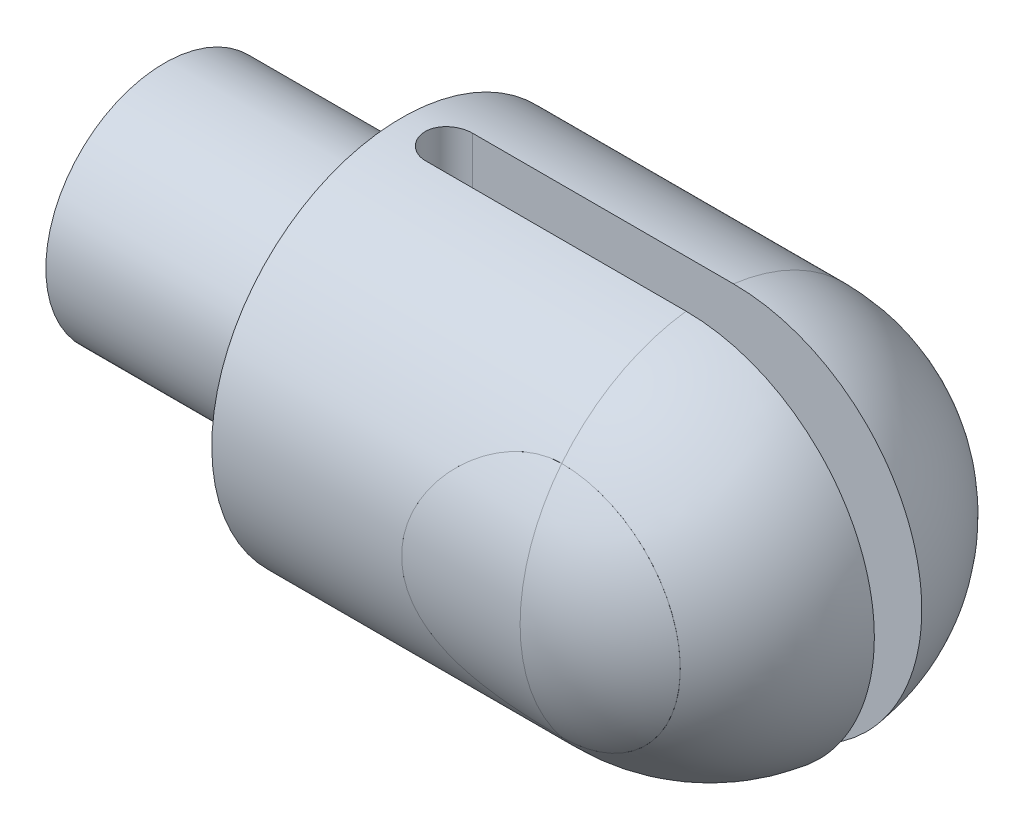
ISO-10303-21;
HEADER;
FILE_DESCRIPTION(('STEP AP214'),'2;1');
FILE_NAME('part.step','',(''),(''),'','','');
FILE_SCHEMA(('AUTOMOTIVE_DESIGN { 1 0 10303 214 1 1 1 1 }'));
ENDSEC;
DATA;
#1=APPLICATION_CONTEXT('core data for automotive mechanical design processes');
#2=APPLICATION_PROTOCOL_DEFINITION('international standard','automotive_design',2000,#1);
#3=PRODUCT_CONTEXT('',#1,'mechanical');
#4=PRODUCT('Part','Part','',(#3));
#5=PRODUCT_RELATED_PRODUCT_CATEGORY('part','',(#4));
#6=PRODUCT_DEFINITION_FORMATION('','',#4);
#7=PRODUCT_DEFINITION_CONTEXT('part definition',#1,'design');
#8=PRODUCT_DEFINITION('design','',#6,#7);
#9=PRODUCT_DEFINITION_SHAPE('','',#8);
#10=(LENGTH_UNIT() NAMED_UNIT(*) SI_UNIT(.MILLI.,.METRE.));
#11=(NAMED_UNIT(*) PLANE_ANGLE_UNIT() SI_UNIT($,.RADIAN.));
#12=(NAMED_UNIT(*) SI_UNIT($,.STERADIAN.) SOLID_ANGLE_UNIT());
#13=UNCERTAINTY_MEASURE_WITH_UNIT(LENGTH_MEASURE(1.E-05),#10,'distance_accuracy_value','');
#14=(GEOMETRIC_REPRESENTATION_CONTEXT(3) GLOBAL_UNCERTAINTY_ASSIGNED_CONTEXT((#13)) GLOBAL_UNIT_ASSIGNED_CONTEXT((#10,
#11,#12)) REPRESENTATION_CONTEXT('',''));
#15=CARTESIAN_POINT('',(0.,0.,0.));
#16=DIRECTION('',(0.,0.,1.));
#17=DIRECTION('',(1.,0.,0.));
#18=AXIS2_PLACEMENT_3D('',#15,#16,#17);
#19=CARTESIAN_POINT('',(23.0027460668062,0.,10.47));
#20=DIRECTION('',(0.,0.,-1.));
#21=DIRECTION('',(-1.,0.,0.));
#22=AXIS2_PLACEMENT_3D('',#19,#20,#21);
#23=CYLINDRICAL_SURFACE('',#22,5.);
#24=CARTESIAN_POINT('',(23.0027460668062,0.,-6.2449979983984));
#25=DIRECTION('',(0.,0.,1.));
#26=DIRECTION('',(1.,0.,0.));
#27=AXIS2_PLACEMENT_3D('',#24,#25,#26);
#28=CIRCLE('',#27,5.);
#29=CARTESIAN_POINT('',(23.0027460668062,5.,-6.2449979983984));
#30=VERTEX_POINT('',#29);
#31=CARTESIAN_POINT('',(23.0027460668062,-5.,-6.2449979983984));
#32=VERTEX_POINT('',#31);
#33=EDGE_CURVE('E74',#30,#32,#28,.F.);
#34=ORIENTED_EDGE('',*,*,#33,.F.);
#35=CARTESIAN_POINT('',(18.0027460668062,0.,-8.));
#36=CARTESIAN_POINT('',(18.0027463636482,0.127079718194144,-7.99999969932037));
#37=CARTESIAN_POINT('',(18.0075972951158,0.254165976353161,-7.99696526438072));
#38=CARTESIAN_POINT('',(18.02693352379,0.507365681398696,-7.98490163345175));
#39=CARTESIAN_POINT('',(18.0414230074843,0.633478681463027,-7.97586983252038));
#40=CARTESIAN_POINT('',(18.0798582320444,0.883879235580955,-7.95201844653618));
#41=CARTESIAN_POINT('',(18.1038172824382,1.00816396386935,-7.93719071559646));
#42=CARTESIAN_POINT('',(18.1608762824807,1.25388007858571,-7.90210083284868));
#43=CARTESIAN_POINT('',(18.1939800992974,1.3753102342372,-7.88183638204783));
#44=CARTESIAN_POINT('',(18.2687136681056,1.61383677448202,-7.83646507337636));
#45=CARTESIAN_POINT('',(18.3102961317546,1.73095311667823,-7.81138511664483));
#46=CARTESIAN_POINT('',(18.4016445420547,1.96091650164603,-7.75685494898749));
#47=CARTESIAN_POINT('',(18.4514136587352,2.07376186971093,-7.7274030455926));
#48=CARTESIAN_POINT('',(18.6122427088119,2.40491190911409,-7.63340708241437));
#49=CARTESIAN_POINT('',(18.7349095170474,2.61609848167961,-7.5631697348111));
#50=CARTESIAN_POINT('',(19.0183000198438,3.03193014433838,-7.40680295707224));
#51=CARTESIAN_POINT('',(19.1812806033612,3.23470598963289,-7.31985233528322));
#52=CARTESIAN_POINT('',(19.5356454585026,3.61195776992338,-7.1412401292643));
#53=CARTESIAN_POINT('',(19.7270678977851,3.78639500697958,-7.04957232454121));
#54=CARTESIAN_POINT('',(20.0470318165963,4.03551059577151,-6.90836217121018));
#55=CARTESIAN_POINT('',(20.1670331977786,4.12074022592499,-6.85772204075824));
#56=CARTESIAN_POINT('',(20.414897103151,4.28074637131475,-6.758996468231));
#57=CARTESIAN_POINT('',(20.5427610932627,4.35552092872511,-6.71091150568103));
#58=CARTESIAN_POINT('',(20.8056302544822,4.49385262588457,-6.61907677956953));
#59=CARTESIAN_POINT('',(20.9406239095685,4.55742717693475,-6.57532033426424));
#60=CARTESIAN_POINT('',(21.2173685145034,4.67278116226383,-6.49385156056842));
#61=CARTESIAN_POINT('',(21.3591194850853,4.72456056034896,-6.45613925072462));
#62=CARTESIAN_POINT('',(21.6108796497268,4.80367778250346,-6.39737739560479));
#63=CARTESIAN_POINT('',(21.7195821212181,4.83387146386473,-6.37454329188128));
#64=CARTESIAN_POINT('',(21.9396652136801,4.8869893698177,-6.33391313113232));
#65=CARTESIAN_POINT('',(22.0510452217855,4.90991524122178,-6.31611593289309));
#66=CARTESIAN_POINT('',(22.2757224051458,4.94817199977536,-6.2861900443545));
#67=CARTESIAN_POINT('',(22.3890171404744,4.96351189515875,-6.27405463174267));
#68=CARTESIAN_POINT('',(22.6168873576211,4.98640391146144,-6.25587655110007));
#69=CARTESIAN_POINT('',(22.7314628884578,4.99395573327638,-6.249834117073));
#70=CARTESIAN_POINT('',(22.9613047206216,5.00115324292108,-6.24407626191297));
#71=CARTESIAN_POINT('',(23.0765720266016,5.00077951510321,-6.24437637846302));
#72=CARTESIAN_POINT('',(23.3066520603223,4.99208386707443,-6.2513301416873));
#73=CARTESIAN_POINT('',(23.4214646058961,4.98375903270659,-6.25798611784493));
#74=CARTESIAN_POINT('',(23.6497671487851,4.95928874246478,-6.27739584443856));
#75=CARTESIAN_POINT('',(23.7632567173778,4.94314081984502,-6.29015151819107));
#76=CARTESIAN_POINT('',(23.9881322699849,4.90327193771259,-6.32127805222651));
#77=CARTESIAN_POINT('',(24.0995173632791,4.87954784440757,-6.33965123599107));
#78=CARTESIAN_POINT('',(24.4243660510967,4.79874186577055,-6.40129934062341));
#79=CARTESIAN_POINT('',(24.6340385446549,4.73140686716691,-6.4516270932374));
#80=CARTESIAN_POINT('',(25.0394281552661,4.57160139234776,-6.565824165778));
#81=CARTESIAN_POINT('',(25.2351403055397,4.47912202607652,-6.62969827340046));
#82=CARTESIAN_POINT('',(25.6460607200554,4.25180409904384,-6.77818972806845));
#83=CARTESIAN_POINT('',(25.8580812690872,4.1122797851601,-6.86445305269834));
#84=CARTESIAN_POINT('',(26.2580952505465,3.80349790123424,-7.04023909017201));
#85=CARTESIAN_POINT('',(26.4460636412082,3.63420977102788,-7.12976507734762));
#86=CARTESIAN_POINT('',(26.7223146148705,3.34462792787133,-7.26825220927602));
#87=CARTESIAN_POINT('',(26.8194888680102,3.23332743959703,-7.31856628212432));
#88=CARTESIAN_POINT('',(27.0040971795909,3.00184758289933,-7.4165140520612));
#89=CARTESIAN_POINT('',(27.0915348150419,2.88167150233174,-7.464148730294));
#90=CARTESIAN_POINT('',(27.2559792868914,2.63291547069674,-7.55548277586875));
#91=CARTESIAN_POINT('',(27.3329833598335,2.50433330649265,-7.59918109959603));
#92=CARTESIAN_POINT('',(27.4756713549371,2.23953943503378,-7.68138405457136));
#93=CARTESIAN_POINT('',(27.5413622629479,2.1033325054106,-7.71989188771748));
#94=CARTESIAN_POINT('',(27.6574149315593,1.83158498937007,-7.78870197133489));
#95=CARTESIAN_POINT('',(27.7084083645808,1.69639792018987,-7.81933279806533));
#96=CARTESIAN_POINT('',(27.7987670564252,1.42097512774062,-7.87404113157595));
#97=CARTESIAN_POINT('',(27.8381389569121,1.2807423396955,-7.89812238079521));
#98=CARTESIAN_POINT('',(27.9046134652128,0.996484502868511,-7.9389934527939));
#99=CARTESIAN_POINT('',(27.9317271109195,0.852462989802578,-7.95578983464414));
#100=CARTESIAN_POINT('',(27.9732364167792,0.561915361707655,-7.98157299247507));
#101=CARTESIAN_POINT('',(27.9876342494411,0.415389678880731,-7.99056110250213));
#102=CARTESIAN_POINT('',(28.0022662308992,0.143238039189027,-7.99969867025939));
#103=CARTESIAN_POINT('',(28.0042869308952,0.017741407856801,-8.00096292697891));
#104=CARTESIAN_POINT('',(27.998888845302,-0.232966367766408,-7.99758945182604));
#105=CARTESIAN_POINT('',(27.9914706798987,-0.358177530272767,-7.9929521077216));
#106=CARTESIAN_POINT('',(27.9673022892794,-0.60732783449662,-7.97789005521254));
#107=CARTESIAN_POINT('',(27.9505529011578,-0.731267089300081,-7.96746586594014));
#108=CARTESIAN_POINT('',(27.9079553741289,-0.97696969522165,-7.9410830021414));
#109=CARTESIAN_POINT('',(27.8821070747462,-1.09873300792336,-7.92512423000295));
#110=CARTESIAN_POINT('',(27.8228366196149,-1.33450834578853,-7.88877344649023));
#111=CARTESIAN_POINT('',(27.7897534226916,-1.44863666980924,-7.86858112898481));
#112=CARTESIAN_POINT('',(27.7158570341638,-1.67350231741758,-7.82384532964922));
#113=CARTESIAN_POINT('',(27.6750412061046,-1.78423846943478,-7.7993003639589));
#114=CARTESIAN_POINT('',(27.5415962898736,-2.11043845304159,-7.7198451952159));
#115=CARTESIAN_POINT('',(27.4379233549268,-2.32007565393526,-7.65908557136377));
#116=CARTESIAN_POINT('',(27.1926740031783,-2.74037159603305,-7.51959499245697));
#117=CARTESIAN_POINT('',(27.0483279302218,-2.94899750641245,-7.43966908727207));
#118=CARTESIAN_POINT('',(26.731574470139,-3.340560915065,-7.27228030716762));
#119=CARTESIAN_POINT('',(26.5591359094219,-3.52346945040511,-7.18480911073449));
#120=CARTESIAN_POINT('',(26.1622010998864,-3.88590040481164,-6.99623419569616));
#121=CARTESIAN_POINT('',(25.9337816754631,-4.06107692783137,-6.89499476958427));
#122=CARTESIAN_POINT('',(25.4472584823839,-4.37121122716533,-6.70267107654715));
#123=CARTESIAN_POINT('',(25.1891754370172,-4.50619684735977,-6.61157980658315));
#124=CARTESIAN_POINT('',(24.7039321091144,-4.70739703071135,-6.46933988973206));
#125=CARTESIAN_POINT('',(24.4816303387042,-4.78209607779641,-6.41382106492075));
#126=CARTESIAN_POINT('',(24.1391805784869,-4.87056932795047,-6.34656596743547));
#127=CARTESIAN_POINT('',(24.0235559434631,-4.89612834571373,-6.32682054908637));
#128=CARTESIAN_POINT('',(23.7899590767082,-4.93906627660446,-6.29335959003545));
#129=CARTESIAN_POINT('',(23.6719878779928,-4.95644870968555,-6.27964145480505));
#130=CARTESIAN_POINT('',(23.4338090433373,-4.98283345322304,-6.25872646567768));
#131=CARTESIAN_POINT('',(23.3135922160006,-4.99178464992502,-6.25156939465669));
#132=CARTESIAN_POINT('',(23.0726111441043,-5.00096567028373,-6.24422754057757));
#133=CARTESIAN_POINT('',(22.951846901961,-5.00119553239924,-6.24404272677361));
#134=CARTESIAN_POINT('',(22.7107705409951,-4.99292458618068,-6.25065867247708));
#135=CARTESIAN_POINT('',(22.590458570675,-4.98442112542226,-6.2574615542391));
#136=CARTESIAN_POINT('',(22.351352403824,-4.95884706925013,-6.27774556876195));
#137=CARTESIAN_POINT('',(22.2325581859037,-4.94177659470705,-6.2912266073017));
#138=CARTESIAN_POINT('',(21.8987746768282,-4.88153513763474,-6.33822773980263));
#139=CARTESIAN_POINT('',(21.6865083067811,-4.82847742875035,-6.37907576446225));
#140=CARTESIAN_POINT('',(21.2741663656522,-4.69670428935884,-6.47669777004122));
#141=CARTESIAN_POINT('',(21.0740959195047,-4.61797815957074,-6.53347839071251));
#142=CARTESIAN_POINT('',(20.6603705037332,-4.42410573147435,-6.66655793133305));
#143=CARTESIAN_POINT('',(20.4489421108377,-4.30533683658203,-6.74449249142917));
#144=CARTESIAN_POINT('',(20.0469953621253,-4.04000963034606,-6.90670498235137));
#145=CARTESIAN_POINT('',(19.8564941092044,-3.89342885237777,-6.99098800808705));
#146=CARTESIAN_POINT('',(19.462662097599,-3.54264024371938,-7.17608994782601));
#147=CARTESIAN_POINT('',(19.2642681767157,-3.33276887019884,-7.27687640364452));
#148=CARTESIAN_POINT('',(18.994645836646,-2.99268031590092,-7.42018359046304));
#149=CARTESIAN_POINT('',(18.9093677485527,-2.87498419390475,-7.46667962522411));
#150=CARTESIAN_POINT('',(18.7488312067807,-2.63162062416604,-7.55588019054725));
#151=CARTESIAN_POINT('',(18.6735675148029,-2.50595739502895,-7.59858669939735));
#152=CARTESIAN_POINT('',(18.5336397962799,-2.24695585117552,-7.67916888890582));
#153=CARTESIAN_POINT('',(18.46900191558,-2.11359966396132,-7.71703260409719));
#154=CARTESIAN_POINT('',(18.3513960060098,-1.84039127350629,-7.78670745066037));
#155=CARTESIAN_POINT('',(18.2984212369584,-1.70054287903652,-7.81852207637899));
#156=CARTESIAN_POINT('',(18.2050331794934,-1.41574969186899,-7.87506644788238));
#157=CARTESIAN_POINT('',(18.164586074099,-1.2708198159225,-7.89981525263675));
#158=CARTESIAN_POINT('',(18.0967950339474,-0.976912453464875,-7.9415135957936));
#159=CARTESIAN_POINT('',(18.069441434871,-0.827938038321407,-7.95846888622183));
#160=CARTESIAN_POINT('',(18.0335645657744,-0.565708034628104,-7.98076605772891));
#161=CARTESIAN_POINT('',(18.0220205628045,-0.453012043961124,-7.98796542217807));
#162=CARTESIAN_POINT('',(18.0066109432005,-0.22687913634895,-7.99758267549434));
#163=CARTESIAN_POINT('',(18.0027458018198,-0.113442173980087,-8.00000026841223));
#164=CARTESIAN_POINT('',(18.0027460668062,0.,-8.));
#165=B_SPLINE_CURVE_WITH_KNOTS('',3,(#35,#36,#37,#38,#39,#40,#41,#42,#43,#44,#45,#46,#47,#48,
#49,#50,#51,#52,#53,#54,#55,#56,#57,#58,#59,#60,#61,#62,#63,#64,#65,#66,#67,#68,#69,#70,#71,#72,
#73,#74,#75,#76,#77,#78,#79,#80,#81,#82,#83,#84,#85,#86,#87,#88,#89,#90,#91,#92,#93,#94,#95,#96,
#97,#98,#99,#100,#101,#102,#103,#104,#105,#106,#107,#108,#109,#110,#111,#112,#113,#114,#115,
#116,#117,#118,#119,#120,#121,#122,#123,#124,#125,#126,#127,#128,#129,#130,#131,#132,#133,#134,
#135,#136,#137,#138,#139,#140,#141,#142,#143,#144,#145,#146,#147,#148,#149,#150,#151,#152,#153,
#154,#155,#156,#157,#158,#159,#160,#161,#162,#163,#164),.UNSPECIFIED.,.T.,.F.,(4,2,2,2,2,2,2,2,
2,2,2,2,2,2,2,2,2,2,2,2,2,2,2,2,2,2,2,2,2,2,2,2,2,2,2,2,2,2,2,2,2,2,2,2,2,2,2,2,2,2,2,2,2,2,2,2,
2,2,2,2,2,2,2,2,4),(0.,0.381122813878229,0.762411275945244,1.14423755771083,1.52622555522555,
1.90613865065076,2.2861992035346,3.04547146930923,3.86537873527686,4.68639638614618,
5.15288943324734,5.61946971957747,6.08531814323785,6.55116799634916,6.89615022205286,
7.24105422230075,7.58554766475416,7.93005433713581,8.27540506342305,8.62088241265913,
8.96646876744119,9.31219825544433,9.98712845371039,10.6622975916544,11.463592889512,
12.2657157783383,12.7334704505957,13.2010527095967,13.6687585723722,14.1361745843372,
14.5786070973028,15.0207862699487,15.4625664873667,15.9042712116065,16.280349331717,
16.6564027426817,17.0324224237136,17.4084487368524,17.7696430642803,18.1309607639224,
18.8530325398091,19.6479898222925,20.4438353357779,21.355208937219,22.2659496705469,
22.9857781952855,23.3455439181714,23.705154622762,24.0669316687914,24.4287071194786,
24.7905924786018,25.1524727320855,25.8172983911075,26.482401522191,27.2437925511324,
28.0058012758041,28.9187931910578,29.3761295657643,29.8332257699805,30.2914303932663,
30.7493695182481,31.2060614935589,31.6624158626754,32.0026174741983,32.3428401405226),.UNSPECIFIED.);
#166=EDGE_CURVE('E70',#32,#30,#165,.T.);
#167=ORIENTED_EDGE('',*,*,#166,.F.);
#168=EDGE_LOOP('',(#34,#167));
#169=FACE_BOUND('',#168,.T.);
#170=CARTESIAN_POINT('',(23.0027460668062,0.,6.2449979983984));
#171=DIRECTION('',(0.,0.,-1.));
#172=DIRECTION('',(-1.,0.,0.));
#173=AXIS2_PLACEMENT_3D('',#170,#171,#172);
#174=CIRCLE('',#173,5.);
#175=CARTESIAN_POINT('',(23.0027460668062,-5.,6.2449979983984));
#176=VERTEX_POINT('',#175);
#177=CARTESIAN_POINT('',(23.0027460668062,5.,6.2449979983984));
#178=VERTEX_POINT('',#177);
#179=EDGE_CURVE('E12',#176,#178,#174,.F.);
#180=ORIENTED_EDGE('',*,*,#179,.F.);
#181=CARTESIAN_POINT('',(18.0027460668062,0.,8.));
#182=CARTESIAN_POINT('',(18.0027463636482,-0.127079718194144,7.99999969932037));
#183=CARTESIAN_POINT('',(18.0075972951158,-0.254165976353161,7.99696526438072));
#184=CARTESIAN_POINT('',(18.02693352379,-0.507365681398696,7.98490163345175));
#185=CARTESIAN_POINT('',(18.0414230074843,-0.633478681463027,7.97586983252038));
#186=CARTESIAN_POINT('',(18.0798582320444,-0.883879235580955,7.95201844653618));
#187=CARTESIAN_POINT('',(18.1038172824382,-1.00816396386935,7.93719071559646));
#188=CARTESIAN_POINT('',(18.1608762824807,-1.25388007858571,7.90210083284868));
#189=CARTESIAN_POINT('',(18.1939800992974,-1.3753102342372,7.88183638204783));
#190=CARTESIAN_POINT('',(18.2687136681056,-1.61383677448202,7.83646507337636));
#191=CARTESIAN_POINT('',(18.3102961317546,-1.73095311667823,7.81138511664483));
#192=CARTESIAN_POINT('',(18.4016445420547,-1.96091650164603,7.75685494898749));
#193=CARTESIAN_POINT('',(18.4514136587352,-2.07376186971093,7.7274030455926));
#194=CARTESIAN_POINT('',(18.6122427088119,-2.40491190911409,7.63340708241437));
#195=CARTESIAN_POINT('',(18.7349095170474,-2.61609848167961,7.5631697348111));
#196=CARTESIAN_POINT('',(19.0183000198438,-3.03193014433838,7.40680295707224));
#197=CARTESIAN_POINT('',(19.1812806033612,-3.23470598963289,7.31985233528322));
#198=CARTESIAN_POINT('',(19.5356454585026,-3.61195776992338,7.1412401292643));
#199=CARTESIAN_POINT('',(19.7270678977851,-3.78639500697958,7.04957232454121));
#200=CARTESIAN_POINT('',(20.0470318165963,-4.03551059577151,6.90836217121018));
#201=CARTESIAN_POINT('',(20.1670331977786,-4.12074022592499,6.85772204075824));
#202=CARTESIAN_POINT('',(20.414897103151,-4.28074637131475,6.758996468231));
#203=CARTESIAN_POINT('',(20.5427610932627,-4.35552092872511,6.71091150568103));
#204=CARTESIAN_POINT('',(20.8056302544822,-4.49385262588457,6.61907677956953));
#205=CARTESIAN_POINT('',(20.9406239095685,-4.55742717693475,6.57532033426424));
#206=CARTESIAN_POINT('',(21.2173685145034,-4.67278116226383,6.49385156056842));
#207=CARTESIAN_POINT('',(21.3591194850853,-4.72456056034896,6.45613925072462));
#208=CARTESIAN_POINT('',(21.6108796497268,-4.80367778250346,6.39737739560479));
#209=CARTESIAN_POINT('',(21.7195821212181,-4.83387146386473,6.37454329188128));
#210=CARTESIAN_POINT('',(21.9396652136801,-4.8869893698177,6.33391313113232));
#211=CARTESIAN_POINT('',(22.0510452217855,-4.90991524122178,6.31611593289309));
#212=CARTESIAN_POINT('',(22.2757224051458,-4.94817199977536,6.2861900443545));
#213=CARTESIAN_POINT('',(22.3890171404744,-4.96351189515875,6.27405463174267));
#214=CARTESIAN_POINT('',(22.6168873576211,-4.98640391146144,6.25587655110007));
#215=CARTESIAN_POINT('',(22.7314628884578,-4.99395573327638,6.249834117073));
#216=CARTESIAN_POINT('',(22.9613047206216,-5.00115324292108,6.24407626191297));
#217=CARTESIAN_POINT('',(23.0765720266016,-5.00077951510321,6.24437637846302));
#218=CARTESIAN_POINT('',(23.3066520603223,-4.99208386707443,6.2513301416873));
#219=CARTESIAN_POINT('',(23.4214646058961,-4.98375903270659,6.25798611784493));
#220=CARTESIAN_POINT('',(23.6497671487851,-4.95928874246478,6.27739584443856));
#221=CARTESIAN_POINT('',(23.7632567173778,-4.94314081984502,6.29015151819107));
#222=CARTESIAN_POINT('',(23.9881322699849,-4.90327193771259,6.32127805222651));
#223=CARTESIAN_POINT('',(24.0995173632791,-4.87954784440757,6.33965123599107));
#224=CARTESIAN_POINT('',(24.4243660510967,-4.79874186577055,6.40129934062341));
#225=CARTESIAN_POINT('',(24.6340385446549,-4.73140686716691,6.4516270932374));
#226=CARTESIAN_POINT('',(25.0394281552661,-4.57160139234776,6.565824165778));
#227=CARTESIAN_POINT('',(25.2351403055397,-4.47912202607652,6.62969827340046));
#228=CARTESIAN_POINT('',(25.6460607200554,-4.25180409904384,6.77818972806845));
#229=CARTESIAN_POINT('',(25.8580812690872,-4.1122797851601,6.86445305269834));
#230=CARTESIAN_POINT('',(26.2580952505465,-3.80349790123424,7.04023909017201));
#231=CARTESIAN_POINT('',(26.4460636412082,-3.63420977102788,7.12976507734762));
#232=CARTESIAN_POINT('',(26.7223146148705,-3.34462792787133,7.26825220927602));
#233=CARTESIAN_POINT('',(26.8194888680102,-3.23332743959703,7.31856628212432));
#234=CARTESIAN_POINT('',(27.0040971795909,-3.00184758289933,7.4165140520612));
#235=CARTESIAN_POINT('',(27.0915348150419,-2.88167150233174,7.464148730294));
#236=CARTESIAN_POINT('',(27.2559792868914,-2.63291547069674,7.55548277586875));
#237=CARTESIAN_POINT('',(27.3329833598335,-2.50433330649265,7.59918109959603));
#238=CARTESIAN_POINT('',(27.4756713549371,-2.23953943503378,7.68138405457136));
#239=CARTESIAN_POINT('',(27.5413622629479,-2.1033325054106,7.71989188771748));
#240=CARTESIAN_POINT('',(27.6574149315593,-1.83158498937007,7.78870197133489));
#241=CARTESIAN_POINT('',(27.7084083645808,-1.69639792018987,7.81933279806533));
#242=CARTESIAN_POINT('',(27.7987670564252,-1.42097512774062,7.87404113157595));
#243=CARTESIAN_POINT('',(27.8381389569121,-1.2807423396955,7.89812238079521));
#244=CARTESIAN_POINT('',(27.9046134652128,-0.996484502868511,7.9389934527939));
#245=CARTESIAN_POINT('',(27.9317271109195,-0.852462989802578,7.95578983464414));
#246=CARTESIAN_POINT('',(27.9732364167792,-0.561915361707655,7.98157299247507));
#247=CARTESIAN_POINT('',(27.9876342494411,-0.415389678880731,7.99056110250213));
#248=CARTESIAN_POINT('',(28.0022662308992,-0.143238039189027,7.99969867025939));
#249=CARTESIAN_POINT('',(28.0042869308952,-0.017741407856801,8.00096292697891));
#250=CARTESIAN_POINT('',(27.998888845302,0.232966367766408,7.99758945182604));
#251=CARTESIAN_POINT('',(27.9914706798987,0.358177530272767,7.9929521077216));
#252=CARTESIAN_POINT('',(27.9673022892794,0.60732783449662,7.97789005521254));
#253=CARTESIAN_POINT('',(27.9505529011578,0.731267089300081,7.96746586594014));
#254=CARTESIAN_POINT('',(27.9079553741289,0.97696969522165,7.9410830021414));
#255=CARTESIAN_POINT('',(27.8821070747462,1.09873300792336,7.92512423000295));
#256=CARTESIAN_POINT('',(27.8228366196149,1.33450834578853,7.88877344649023));
#257=CARTESIAN_POINT('',(27.7897534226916,1.44863666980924,7.86858112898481));
#258=CARTESIAN_POINT('',(27.7158570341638,1.67350231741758,7.82384532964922));
#259=CARTESIAN_POINT('',(27.6750412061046,1.78423846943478,7.7993003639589));
#260=CARTESIAN_POINT('',(27.5415962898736,2.11043845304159,7.7198451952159));
#261=CARTESIAN_POINT('',(27.4379233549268,2.32007565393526,7.65908557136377));
#262=CARTESIAN_POINT('',(27.1926740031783,2.74037159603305,7.51959499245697));
#263=CARTESIAN_POINT('',(27.0483279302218,2.94899750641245,7.43966908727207));
#264=CARTESIAN_POINT('',(26.731574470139,3.340560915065,7.27228030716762));
#265=CARTESIAN_POINT('',(26.5591359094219,3.52346945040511,7.18480911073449));
#266=CARTESIAN_POINT('',(26.1622010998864,3.88590040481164,6.99623419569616));
#267=CARTESIAN_POINT('',(25.9337816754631,4.06107692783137,6.89499476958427));
#268=CARTESIAN_POINT('',(25.4472584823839,4.37121122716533,6.70267107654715));
#269=CARTESIAN_POINT('',(25.1891754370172,4.50619684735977,6.61157980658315));
#270=CARTESIAN_POINT('',(24.7039321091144,4.70739703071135,6.46933988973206));
#271=CARTESIAN_POINT('',(24.4816303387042,4.78209607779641,6.41382106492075));
#272=CARTESIAN_POINT('',(24.1391805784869,4.87056932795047,6.34656596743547));
#273=CARTESIAN_POINT('',(24.0235559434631,4.89612834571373,6.32682054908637));
#274=CARTESIAN_POINT('',(23.7899590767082,4.93906627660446,6.29335959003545));
#275=CARTESIAN_POINT('',(23.6719878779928,4.95644870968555,6.27964145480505));
#276=CARTESIAN_POINT('',(23.4338090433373,4.98283345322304,6.25872646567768));
#277=CARTESIAN_POINT('',(23.3135922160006,4.99178464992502,6.25156939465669));
#278=CARTESIAN_POINT('',(23.0726111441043,5.00096567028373,6.24422754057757));
#279=CARTESIAN_POINT('',(22.951846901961,5.00119553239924,6.24404272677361));
#280=CARTESIAN_POINT('',(22.7107705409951,4.99292458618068,6.25065867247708));
#281=CARTESIAN_POINT('',(22.590458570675,4.98442112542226,6.2574615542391));
#282=CARTESIAN_POINT('',(22.351352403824,4.95884706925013,6.27774556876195));
#283=CARTESIAN_POINT('',(22.2325581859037,4.94177659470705,6.2912266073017));
#284=CARTESIAN_POINT('',(21.8987746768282,4.88153513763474,6.33822773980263));
#285=CARTESIAN_POINT('',(21.6865083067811,4.82847742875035,6.37907576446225));
#286=CARTESIAN_POINT('',(21.2741663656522,4.69670428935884,6.47669777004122));
#287=CARTESIAN_POINT('',(21.0740959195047,4.61797815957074,6.53347839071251));
#288=CARTESIAN_POINT('',(20.6603705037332,4.42410573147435,6.66655793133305));
#289=CARTESIAN_POINT('',(20.4489421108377,4.30533683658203,6.74449249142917));
#290=CARTESIAN_POINT('',(20.0469953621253,4.04000963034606,6.90670498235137));
#291=CARTESIAN_POINT('',(19.8564941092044,3.89342885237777,6.99098800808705));
#292=CARTESIAN_POINT('',(19.462662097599,3.54264024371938,7.17608994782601));
#293=CARTESIAN_POINT('',(19.2642681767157,3.33276887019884,7.27687640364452));
#294=CARTESIAN_POINT('',(18.994645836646,2.99268031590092,7.42018359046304));
#295=CARTESIAN_POINT('',(18.9093677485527,2.87498419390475,7.46667962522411));
#296=CARTESIAN_POINT('',(18.7488312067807,2.63162062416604,7.55588019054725));
#297=CARTESIAN_POINT('',(18.6735675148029,2.50595739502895,7.59858669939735));
#298=CARTESIAN_POINT('',(18.5336397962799,2.24695585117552,7.67916888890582));
#299=CARTESIAN_POINT('',(18.46900191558,2.11359966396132,7.71703260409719));
#300=CARTESIAN_POINT('',(18.3513960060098,1.84039127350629,7.78670745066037));
#301=CARTESIAN_POINT('',(18.2984212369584,1.70054287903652,7.81852207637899));
#302=CARTESIAN_POINT('',(18.2050331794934,1.41574969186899,7.87506644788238));
#303=CARTESIAN_POINT('',(18.164586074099,1.2708198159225,7.89981525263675));
#304=CARTESIAN_POINT('',(18.0967950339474,0.976912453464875,7.9415135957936));
#305=CARTESIAN_POINT('',(18.069441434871,0.827938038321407,7.95846888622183));
#306=CARTESIAN_POINT('',(18.0335645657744,0.565708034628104,7.98076605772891));
#307=CARTESIAN_POINT('',(18.0220205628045,0.453012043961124,7.98796542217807));
#308=CARTESIAN_POINT('',(18.0066109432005,0.22687913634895,7.99758267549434));
#309=CARTESIAN_POINT('',(18.0027458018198,0.113442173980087,8.00000026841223));
#310=CARTESIAN_POINT('',(18.0027460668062,0.,8.));
#311=B_SPLINE_CURVE_WITH_KNOTS('',3,(#181,#182,#183,#184,#185,#186,#187,#188,#189,#190,#191,
#192,#193,#194,#195,#196,#197,#198,#199,#200,#201,#202,#203,#204,#205,#206,#207,#208,#209,#210,
#211,#212,#213,#214,#215,#216,#217,#218,#219,#220,#221,#222,#223,#224,#225,#226,#227,#228,#229,
#230,#231,#232,#233,#234,#235,#236,#237,#238,#239,#240,#241,#242,#243,#244,#245,#246,#247,#248,
#249,#250,#251,#252,#253,#254,#255,#256,#257,#258,#259,#260,#261,#262,#263,#264,#265,#266,#267,
#268,#269,#270,#271,#272,#273,#274,#275,#276,#277,#278,#279,#280,#281,#282,#283,#284,#285,#286,
#287,#288,#289,#290,#291,#292,#293,#294,#295,#296,#297,#298,#299,#300,#301,#302,#303,#304,#305,
#306,#307,#308,#309,#310),.UNSPECIFIED.,.T.,.F.,(4,2,2,2,2,2,2,2,2,2,2,2,2,2,2,2,2,2,2,2,2,2,2,
2,2,2,2,2,2,2,2,2,2,2,2,2,2,2,2,2,2,2,2,2,2,2,2,2,2,2,2,2,2,2,2,2,2,2,2,2,2,2,2,2,4),(0.,
0.381122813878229,0.762411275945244,1.14423755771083,1.52622555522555,1.90613865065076,
2.2861992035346,3.04547146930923,3.86537873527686,4.68639638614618,5.15288943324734,
5.61946971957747,6.08531814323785,6.55116799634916,6.89615022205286,7.24105422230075,
7.58554766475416,7.93005433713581,8.27540506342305,8.62088241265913,8.96646876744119,
9.31219825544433,9.98712845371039,10.6622975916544,11.463592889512,12.2657157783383,
12.7334704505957,13.2010527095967,13.6687585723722,14.1361745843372,14.5786070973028,
15.0207862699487,15.4625664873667,15.9042712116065,16.280349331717,16.6564027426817,
17.0324224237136,17.4084487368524,17.7696430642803,18.1309607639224,18.8530325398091,
19.6479898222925,20.4438353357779,21.355208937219,22.2659496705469,22.9857781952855,
23.3455439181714,23.705154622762,24.0669316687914,24.4287071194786,24.7905924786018,
25.1524727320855,25.8172983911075,26.482401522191,27.2437925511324,28.0058012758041,
28.9187931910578,29.3761295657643,29.8332257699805,30.2914303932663,30.7493695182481,
31.2060614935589,31.6624158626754,32.0026174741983,32.3428401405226),.UNSPECIFIED.);
#312=EDGE_CURVE('E52',#178,#176,#311,.T.);
#313=ORIENTED_EDGE('',*,*,#312,.F.);
#314=EDGE_LOOP('',(#180,#313));
#315=FACE_BOUND('',#314,.T.);
#316=ADVANCED_FACE('F44',(#169,#315),#23,.T.);
#317=CARTESIAN_POINT('',(0.,0.,0.));
#318=DIRECTION('',(-1.,0.,0.));
#319=DIRECTION('',(0.,0.,1.));
#320=AXIS2_PLACEMENT_3D('',#317,#318,#319);
#321=CYLINDRICAL_SURFACE('',#320,8.);
#322=ORIENTED_EDGE('',*,*,#166,.T.);
#323=CARTESIAN_POINT('',(23.0027460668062,0.,0.));
#324=DIRECTION('',(-1.,0.,0.));
#325=DIRECTION('',(0.,0.,1.));
#326=AXIS2_PLACEMENT_3D('',#323,#324,#325);
#327=CIRCLE('',#326,8.);
#328=EDGE_CURVE('E64',#30,#32,#327,.T.);
#329=ORIENTED_EDGE('',*,*,#328,.T.);
#330=EDGE_LOOP('',(#322,#329));
#331=FACE_BOUND('',#330,.T.);
#332=ADVANCED_FACE('F71',(#331),#321,.T.);
#333=CARTESIAN_POINT('',(23.0027460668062,0.,0.));
#334=DIRECTION('',(-1.,0.,0.));
#335=DIRECTION('',(0.,1.,0.));
#336=AXIS2_PLACEMENT_3D('',#333,#334,#335);
#337=SPHERICAL_SURFACE('',#336,8.);
#338=ORIENTED_EDGE('',*,*,#33,.T.);
#339=ORIENTED_EDGE('',*,*,#328,.F.);
#340=EDGE_LOOP('',(#338,#339));
#341=FACE_BOUND('',#340,.T.);
#342=ADVANCED_FACE('F77',(#341),#337,.T.);
#343=ORIENTED_EDGE('',*,*,#179,.T.);
#344=EDGE_CURVE('E58',#176,#178,#327,.T.);
#345=ORIENTED_EDGE('',*,*,#344,.F.);
#346=EDGE_LOOP('',(#343,#345));
#347=FACE_BOUND('',#346,.T.);
#348=ADVANCED_FACE('F89',(#347),#337,.T.);
#349=ORIENTED_EDGE('',*,*,#312,.T.);
#350=ORIENTED_EDGE('',*,*,#344,.T.);
#351=EDGE_LOOP('',(#349,#350));
#352=FACE_BOUND('',#351,.T.);
#353=ADVANCED_FACE('F86',(#352),#321,.T.);
#354=CLOSED_SHELL('',(#316,#332,#342,#348,#353));
#355=MANIFOLD_SOLID_BREP('B2',#354);
#356=CARTESIAN_POINT('',(30.94,0.,0.));
#357=DIRECTION('',(-1.,0.,0.));
#358=DIRECTION('',(0.,0.,1.));
#359=AXIS2_PLACEMENT_3D('',#356,#357,#358);
#360=CYLINDRICAL_SURFACE('',#359,8.);
#361=CARTESIAN_POINT('',(10.,0.,0.));
#362=DIRECTION('',(1.,0.,0.));
#363=DIRECTION('',(0.,0.,-1.));
#364=AXIS2_PLACEMENT_3D('',#361,#362,#363);
#365=CIRCLE('',#364,8.);
#366=CARTESIAN_POINT('',(10.,0.,-8.));
#367=VERTEX_POINT('',#366);
#368=EDGE_CURVE('E216',#367,#367,#365,.T.);
#369=ORIENTED_EDGE('',*,*,#368,.T.);
#370=EDGE_LOOP('',(#369));
#371=FACE_BOUND('',#370,.T.);
#372=CARTESIAN_POINT('',(23.0027460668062,0.,0.));
#373=DIRECTION('',(-1.,0.,0.));
#374=DIRECTION('',(0.,0.,1.));
#375=AXIS2_PLACEMENT_3D('',#372,#373,#374);
#376=CIRCLE('',#375,8.);
#377=CARTESIAN_POINT('',(23.0027460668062,-7.93725393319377,1.));
#378=VERTEX_POINT('',#377);
#379=CARTESIAN_POINT('',(23.0027460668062,-5.,6.2449979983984));
#380=VERTEX_POINT('',#379);
#381=EDGE_CURVE('E185',#378,#380,#376,.T.);
#382=ORIENTED_EDGE('',*,*,#381,.T.);
#383=CARTESIAN_POINT('',(28.0027460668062,0.,8.));
#384=CARTESIAN_POINT('',(28.0027457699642,-0.127079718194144,7.99999969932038));
#385=CARTESIAN_POINT('',(27.9978948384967,-0.254165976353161,7.99696526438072));
#386=CARTESIAN_POINT('',(27.9785586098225,-0.507365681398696,7.98490163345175));
#387=CARTESIAN_POINT('',(27.9640691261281,-0.633478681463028,7.97586983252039));
#388=CARTESIAN_POINT('',(27.925633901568,-0.883879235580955,7.95201844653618));
#389=CARTESIAN_POINT('',(27.9016748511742,-1.00816396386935,7.93719071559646));
#390=CARTESIAN_POINT('',(27.8446158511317,-1.25388007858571,7.90210083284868));
#391=CARTESIAN_POINT('',(27.811512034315,-1.3753102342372,7.88183638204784));
#392=CARTESIAN_POINT('',(27.7367784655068,-1.61383677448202,7.83646507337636));
#393=CARTESIAN_POINT('',(27.6951960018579,-1.73095311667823,7.81138511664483));
#394=CARTESIAN_POINT('',(27.6038475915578,-1.96091650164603,7.75685494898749));
#395=CARTESIAN_POINT('',(27.5540784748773,-2.07376186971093,7.7274030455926));
#396=CARTESIAN_POINT('',(27.3932494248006,-2.40491190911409,7.63340708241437));
#397=CARTESIAN_POINT('',(27.2705826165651,-2.61609848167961,7.5631697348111));
#398=CARTESIAN_POINT('',(26.9871921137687,-3.03193014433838,7.40680295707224));
#399=CARTESIAN_POINT('',(26.8242115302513,-3.23470598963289,7.31985233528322));
#400=CARTESIAN_POINT('',(26.4698466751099,-3.61195776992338,7.1412401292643));
#401=CARTESIAN_POINT('',(26.2784242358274,-3.78639500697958,7.04957232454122));
#402=CARTESIAN_POINT('',(25.9584603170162,-4.03551059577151,6.90836217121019));
#403=CARTESIAN_POINT('',(25.8384589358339,-4.12074022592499,6.85772204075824));
#404=CARTESIAN_POINT('',(25.5905950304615,-4.28074637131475,6.75899646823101));
#405=CARTESIAN_POINT('',(25.4627310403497,-4.35552092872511,6.71091150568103));
#406=CARTESIAN_POINT('',(25.1998618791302,-4.49385262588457,6.61907677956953));
#407=CARTESIAN_POINT('',(25.064868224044,-4.55742717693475,6.57532033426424));
#408=CARTESIAN_POINT('',(24.7881236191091,-4.67278116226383,6.49385156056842));
#409=CARTESIAN_POINT('',(24.6463726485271,-4.72456056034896,6.45613925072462));
#410=CARTESIAN_POINT('',(24.3946124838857,-4.80367778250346,6.39737739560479));
#411=CARTESIAN_POINT('',(24.2859100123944,-4.83387146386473,6.37454329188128));
#412=CARTESIAN_POINT('',(24.0658269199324,-4.8869893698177,6.33391313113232));
#413=CARTESIAN_POINT('',(23.954446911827,-4.90991524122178,6.31611593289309));
#414=CARTESIAN_POINT('',(23.7297697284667,-4.94817199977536,6.28619004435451));
#415=CARTESIAN_POINT('',(23.6164749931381,-4.96351189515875,6.27405463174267));
#416=CARTESIAN_POINT('',(23.3886047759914,-4.98640391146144,6.25587655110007));
#417=CARTESIAN_POINT('',(23.2740292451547,-4.99395573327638,6.249834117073));
#418=CARTESIAN_POINT('',(23.0441874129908,-5.00115324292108,6.24407626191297));
#419=CARTESIAN_POINT('',(22.9289201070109,-5.00077951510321,6.24437637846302));
#420=CARTESIAN_POINT('',(22.6988400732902,-4.99208386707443,6.2513301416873));
#421=CARTESIAN_POINT('',(22.5840275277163,-4.98375903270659,6.25798611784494));
#422=CARTESIAN_POINT('',(22.3557249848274,-4.95928874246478,6.27739584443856));
#423=CARTESIAN_POINT('',(22.2422354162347,-4.94314081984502,6.29015151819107));
#424=CARTESIAN_POINT('',(22.0173598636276,-4.90327193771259,6.32127805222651));
#425=CARTESIAN_POINT('',(21.9059747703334,-4.87954784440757,6.33965123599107));
#426=CARTESIAN_POINT('',(21.5811260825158,-4.79874186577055,6.40129934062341));
#427=CARTESIAN_POINT('',(21.3714535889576,-4.73140686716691,6.45162709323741));
#428=CARTESIAN_POINT('',(20.9660639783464,-4.57160139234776,6.565824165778));
#429=CARTESIAN_POINT('',(20.7703518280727,-4.47912202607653,6.62969827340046));
#430=CARTESIAN_POINT('',(20.359431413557,-4.25180409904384,6.77818972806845));
#431=CARTESIAN_POINT('',(20.1474108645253,-4.11227978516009,6.86445305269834));
#432=CARTESIAN_POINT('',(19.747396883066,-3.80349790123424,7.04023909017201));
#433=CARTESIAN_POINT('',(19.5594284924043,-3.63420977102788,7.12976507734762));
#434=CARTESIAN_POINT('',(19.2831775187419,-3.34462792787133,7.26825220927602));
#435=CARTESIAN_POINT('',(19.1860032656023,-3.23332743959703,7.31856628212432));
#436=CARTESIAN_POINT('',(19.0013949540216,-3.00184758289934,7.4165140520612));
#437=CARTESIAN_POINT('',(18.9139573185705,-2.88167150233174,7.46414873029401));
#438=CARTESIAN_POINT('',(18.7495128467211,-2.63291547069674,7.55548277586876));
#439=CARTESIAN_POINT('',(18.6725087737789,-2.50433330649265,7.59918109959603));
#440=CARTESIAN_POINT('',(18.5298207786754,-2.23953943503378,7.68138405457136));
#441=CARTESIAN_POINT('',(18.4641298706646,-2.1033325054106,7.71989188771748));
#442=CARTESIAN_POINT('',(18.3480772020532,-1.83158498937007,7.78870197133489));
#443=CARTESIAN_POINT('',(18.2970837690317,-1.69639792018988,7.81933279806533));
#444=CARTESIAN_POINT('',(18.2067250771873,-1.42097512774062,7.87404113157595));
#445=CARTESIAN_POINT('',(18.1673531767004,-1.28074233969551,7.89812238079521));
#446=CARTESIAN_POINT('',(18.1008786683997,-0.996484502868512,7.93899345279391));
#447=CARTESIAN_POINT('',(18.073765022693,-0.85246298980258,7.95578983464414));
#448=CARTESIAN_POINT('',(18.0322557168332,-0.561915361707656,7.98157299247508));
#449=CARTESIAN_POINT('',(18.0178578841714,-0.415389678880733,7.99056110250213));
#450=CARTESIAN_POINT('',(18.0032259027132,-0.143238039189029,7.99969867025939));
#451=CARTESIAN_POINT('',(18.0012052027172,-0.017741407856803,8.00096292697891));
#452=CARTESIAN_POINT('',(18.0066032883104,0.232966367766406,7.99758945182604));
#453=CARTESIAN_POINT('',(18.0140214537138,0.358177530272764,7.9929521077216));
#454=CARTESIAN_POINT('',(18.0381898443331,0.607327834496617,7.97789005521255));
#455=CARTESIAN_POINT('',(18.0549392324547,0.731267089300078,7.96746586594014));
#456=CARTESIAN_POINT('',(18.0975367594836,0.976969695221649,7.94108300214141));
#457=CARTESIAN_POINT('',(18.1233850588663,1.09873300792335,7.92512423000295));
#458=CARTESIAN_POINT('',(18.1826555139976,1.33450834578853,7.88877344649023));
#459=CARTESIAN_POINT('',(18.2157387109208,1.44863666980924,7.86858112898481));
#460=CARTESIAN_POINT('',(18.2896350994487,1.67350231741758,7.82384532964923));
#461=CARTESIAN_POINT('',(18.3304509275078,1.78423846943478,7.7993003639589));
#462=CARTESIAN_POINT('',(18.4638958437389,2.11043845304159,7.7198451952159));
#463=CARTESIAN_POINT('',(18.5675687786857,2.32007565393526,7.65908557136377));
#464=CARTESIAN_POINT('',(18.8128181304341,2.74037159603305,7.51959499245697));
#465=CARTESIAN_POINT('',(18.9571642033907,2.94899750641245,7.43966908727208));
#466=CARTESIAN_POINT('',(19.2739176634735,3.340560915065,7.27228030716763));
#467=CARTESIAN_POINT('',(19.4463562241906,3.52346945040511,7.18480911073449));
#468=CARTESIAN_POINT('',(19.8432910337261,3.88590040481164,6.99623419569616));
#469=CARTESIAN_POINT('',(20.0717104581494,4.06107692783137,6.89499476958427));
#470=CARTESIAN_POINT('',(20.5582336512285,4.37121122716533,6.70267107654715));
#471=CARTESIAN_POINT('',(20.8163166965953,4.50619684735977,6.61157980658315));
#472=CARTESIAN_POINT('',(21.3015600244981,4.70739703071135,6.46933988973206));
#473=CARTESIAN_POINT('',(21.5238617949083,4.78209607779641,6.41382106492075));
#474=CARTESIAN_POINT('',(21.8663115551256,4.87056932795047,6.34656596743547));
#475=CARTESIAN_POINT('',(21.9819361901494,4.89612834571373,6.32682054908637));
#476=CARTESIAN_POINT('',(22.2155330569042,4.93906627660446,6.29335959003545));
#477=CARTESIAN_POINT('',(22.3335042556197,4.95644870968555,6.27964145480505));
#478=CARTESIAN_POINT('',(22.5716830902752,4.98283345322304,6.25872646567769));
#479=CARTESIAN_POINT('',(22.6918999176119,4.99178464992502,6.25156939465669));
#480=CARTESIAN_POINT('',(22.9328809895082,5.00096567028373,6.24422754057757));
#481=CARTESIAN_POINT('',(23.0536452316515,5.00119553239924,6.24404272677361));
#482=CARTESIAN_POINT('',(23.2947215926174,4.99292458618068,6.25065867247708));
#483=CARTESIAN_POINT('',(23.4150335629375,4.98442112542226,6.2574615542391));
#484=CARTESIAN_POINT('',(23.6541397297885,4.95884706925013,6.27774556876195));
#485=CARTESIAN_POINT('',(23.7729339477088,4.94177659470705,6.2912266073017));
#486=CARTESIAN_POINT('',(24.1067174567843,4.88153513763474,6.33822773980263));
#487=CARTESIAN_POINT('',(24.3189838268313,4.82847742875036,6.37907576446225));
#488=CARTESIAN_POINT('',(24.7313257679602,4.69670428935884,6.47669777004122));
#489=CARTESIAN_POINT('',(24.9313962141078,4.61797815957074,6.53347839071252));
#490=CARTESIAN_POINT('',(25.3451216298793,4.42410573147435,6.66655793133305));
#491=CARTESIAN_POINT('',(25.5565500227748,4.30533683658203,6.74449249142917));
#492=CARTESIAN_POINT('',(25.9584967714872,4.04000963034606,6.90670498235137));
#493=CARTESIAN_POINT('',(26.1489980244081,3.89342885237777,6.99098800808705));
#494=CARTESIAN_POINT('',(26.5428300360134,3.54264024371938,7.17608994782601));
#495=CARTESIAN_POINT('',(26.7412239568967,3.33276887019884,7.27687640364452));
#496=CARTESIAN_POINT('',(27.0108462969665,2.99268031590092,7.42018359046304));
#497=CARTESIAN_POINT('',(27.0961243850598,2.87498419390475,7.46667962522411));
#498=CARTESIAN_POINT('',(27.2566609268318,2.63162062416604,7.55588019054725));
#499=CARTESIAN_POINT('',(27.3319246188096,2.50595739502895,7.59858669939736));
#500=CARTESIAN_POINT('',(27.4718523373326,2.24695585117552,7.67916888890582));
#501=CARTESIAN_POINT('',(27.5364902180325,2.11359966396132,7.71703260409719));
#502=CARTESIAN_POINT('',(27.6540961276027,1.84039127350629,7.78670745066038));
#503=CARTESIAN_POINT('',(27.7070708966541,1.70054287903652,7.81852207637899));
#504=CARTESIAN_POINT('',(27.8004589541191,1.41574969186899,7.87506644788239));
#505=CARTESIAN_POINT('',(27.8409060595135,1.2708198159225,7.89981525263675));
#506=CARTESIAN_POINT('',(27.908697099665,0.976912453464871,7.9415135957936));
#507=CARTESIAN_POINT('',(27.9360506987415,0.827938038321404,7.95846888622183));
#508=CARTESIAN_POINT('',(27.9719275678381,0.565708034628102,7.98076605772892));
#509=CARTESIAN_POINT('',(27.983471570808,0.453012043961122,7.98796542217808));
#510=CARTESIAN_POINT('',(27.9988811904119,0.226879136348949,7.99758267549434));
#511=CARTESIAN_POINT('',(28.0027463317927,0.113442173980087,8.00000026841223));
#512=CARTESIAN_POINT('',(28.0027460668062,0.,8.));
#513=B_SPLINE_CURVE_WITH_KNOTS('',3,(#383,#384,#385,#386,#387,#388,#389,#390,#391,#392,#393,
#394,#395,#396,#397,#398,#399,#400,#401,#402,#403,#404,#405,#406,#407,#408,#409,#410,#411,#412,
#413,#414,#415,#416,#417,#418,#419,#420,#421,#422,#423,#424,#425,#426,#427,#428,#429,#430,#431,
#432,#433,#434,#435,#436,#437,#438,#439,#440,#441,#442,#443,#444,#445,#446,#447,#448,#449,#450,
#451,#452,#453,#454,#455,#456,#457,#458,#459,#460,#461,#462,#463,#464,#465,#466,#467,#468,#469,
#470,#471,#472,#473,#474,#475,#476,#477,#478,#479,#480,#481,#482,#483,#484,#485,#486,#487,#488,
#489,#490,#491,#492,#493,#494,#495,#496,#497,#498,#499,#500,#501,#502,#503,#504,#505,#506,#507,
#508,#509,#510,#511,#512),.UNSPECIFIED.,.T.,.F.,(4,2,2,2,2,2,2,2,2,2,2,2,2,2,2,2,2,2,2,2,2,2,2,
2,2,2,2,2,2,2,2,2,2,2,2,2,2,2,2,2,2,2,2,2,2,2,2,2,2,2,2,2,2,2,2,2,2,2,2,2,2,2,2,2,4),(0.,
0.381122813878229,0.762411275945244,1.14423755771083,1.52622555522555,1.90613865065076,
2.2861992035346,3.04547146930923,3.86537873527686,4.68639638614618,5.15288943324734,
5.61946971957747,6.08531814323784,6.55116799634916,6.89615022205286,7.24105422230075,
7.58554766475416,7.93005433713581,8.27540506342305,8.62088241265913,8.96646876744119,
9.31219825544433,9.98712845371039,10.6622975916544,11.463592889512,12.2657157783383,
12.7334704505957,13.2010527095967,13.6687585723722,14.1361745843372,14.5786070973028,
15.0207862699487,15.4625664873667,15.9042712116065,16.280349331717,16.6564027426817,
17.0324224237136,17.4084487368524,17.7696430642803,18.1309607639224,18.8530325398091,
19.6479898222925,20.4438353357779,21.355208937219,22.2659496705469,22.9857781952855,
23.3455439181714,23.705154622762,24.0669316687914,24.4287071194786,24.7905924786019,
25.1524727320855,25.8172983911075,26.482401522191,27.2437925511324,28.0058012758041,
28.9187931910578,29.3761295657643,29.8332257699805,30.2914303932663,30.7493695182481,
31.2060614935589,31.6624158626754,32.0026174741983,32.3428401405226),.UNSPECIFIED.);
#514=CARTESIAN_POINT('',(23.0027460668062,5.,6.2449979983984));
#515=VERTEX_POINT('',#514);
#516=EDGE_CURVE('E198',#380,#515,#513,.T.);
#517=ORIENTED_EDGE('',*,*,#516,.T.);
#518=CARTESIAN_POINT('',(23.0027460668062,7.93725393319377,1.));
#519=VERTEX_POINT('',#518);
#520=EDGE_CURVE('E147',#515,#519,#376,.T.);
#521=ORIENTED_EDGE('',*,*,#520,.T.);
#522=DIRECTION('',(-1.,0.,0.));
#523=VECTOR('',#522,1.);
#524=CARTESIAN_POINT('',(30.94,7.93725393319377,1.));
#525=LINE('',#524,#523);
#526=CARTESIAN_POINT('',(12.,7.93725393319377,1.));
#527=VERTEX_POINT('',#526);
#528=EDGE_CURVE('E195',#519,#527,#525,.T.);
#529=ORIENTED_EDGE('',*,*,#528,.T.);
#530=CARTESIAN_POINT('',(12.,7.93725393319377,1.));
#531=CARTESIAN_POINT('',(11.9440654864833,7.93725473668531,0.999997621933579));
#532=CARTESIAN_POINT('',(11.8880960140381,7.93785158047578,0.995291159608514));
#533=CARTESIAN_POINT('',(11.7777147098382,7.94017356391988,0.976590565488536));
#534=CARTESIAN_POINT('',(11.7233045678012,7.94189988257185,0.962586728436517));
#535=CARTESIAN_POINT('',(11.6176560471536,7.94628229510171,0.925710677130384));
#536=CARTESIAN_POINT('',(11.5664155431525,7.9489377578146,0.902844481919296));
#537=CARTESIAN_POINT('',(11.4685086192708,7.95487849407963,0.848905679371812));
#538=CARTESIAN_POINT('',(11.4218414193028,7.95816365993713,0.817834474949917));
#539=CARTESIAN_POINT('',(11.3341351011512,7.9650142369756,0.748181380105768));
#540=CARTESIAN_POINT('',(11.2931252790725,7.96858096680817,0.709562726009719));
#541=CARTESIAN_POINT('',(11.2181508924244,7.97558093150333,0.625990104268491));
#542=CARTESIAN_POINT('',(11.1841866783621,7.97901415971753,0.581035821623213));
#543=CARTESIAN_POINT('',(11.1241625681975,7.98537377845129,0.485883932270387));
#544=CARTESIAN_POINT('',(11.0981291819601,7.98829845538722,0.435669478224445));
#545=CARTESIAN_POINT('',(11.0548755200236,7.99329694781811,0.331538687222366));
#546=CARTESIAN_POINT('',(11.0376549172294,7.99537079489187,0.277622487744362));
#547=CARTESIAN_POINT('',(11.0126031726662,7.99842467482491,0.167918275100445));
#548=CARTESIAN_POINT('',(11.0047233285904,7.99941037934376,0.112141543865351));
#549=CARTESIAN_POINT('',(10.9984258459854,8.00019627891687,4.92802746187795E-05));
#550=CARTESIAN_POINT('',(11.000007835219,7.99999652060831,-0.0562662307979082));
#551=CARTESIAN_POINT('',(11.012550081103,7.99843859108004,-0.167506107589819));
#552=CARTESIAN_POINT('',(11.0234579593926,7.99708688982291,-0.222436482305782));
#553=CARTESIAN_POINT('',(11.054260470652,7.99338422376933,-0.329680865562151));
#554=CARTESIAN_POINT('',(11.0741552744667,7.99103323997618,-0.381994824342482));
#555=CARTESIAN_POINT('',(11.1224225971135,7.98558503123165,-0.482683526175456));
#556=CARTESIAN_POINT('',(11.1508177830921,7.98248581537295,-0.531047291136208));
#557=CARTESIAN_POINT('',(11.2152633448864,7.97588787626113,-0.622342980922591));
#558=CARTESIAN_POINT('',(11.2513140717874,7.97238913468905,-0.665274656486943));
#559=CARTESIAN_POINT('',(11.3303407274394,7.96535547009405,-0.744795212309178));
#560=CARTESIAN_POINT('',(11.3733623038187,7.96182046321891,-0.781338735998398));
#561=CARTESIAN_POINT('',(11.464952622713,7.95513628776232,-0.846693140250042));
#562=CARTESIAN_POINT('',(11.5135213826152,7.95198712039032,-0.875503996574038));
#563=CARTESIAN_POINT('',(11.6148677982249,7.94643121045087,-0.924577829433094));
#564=CARTESIAN_POINT('',(11.6676472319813,7.94402478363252,-0.944837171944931));
#565=CARTESIAN_POINT('',(11.7758957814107,7.94023296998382,-0.976192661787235));
#566=CARTESIAN_POINT('',(11.8313647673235,7.93884753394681,-0.987289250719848));
#567=CARTESIAN_POINT('',(11.9430172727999,7.9372635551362,-0.999944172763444));
#568=CARTESIAN_POINT('',(11.9991934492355,7.9370570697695,-1.00156633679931));
#569=CARTESIAN_POINT('',(12.1110167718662,7.93783336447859,-0.995394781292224));
#570=CARTESIAN_POINT('',(12.1666639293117,7.9388161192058,-0.987601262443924));
#571=CARTESIAN_POINT('',(12.2756583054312,7.94185291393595,-0.962873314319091));
#572=CARTESIAN_POINT('',(12.3290126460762,7.94390333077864,-0.945969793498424));
#573=CARTESIAN_POINT('',(12.4321296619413,7.94884147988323,-0.903533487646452));
#574=CARTESIAN_POINT('',(12.4818922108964,7.95172924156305,-0.878000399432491));
#575=CARTESIAN_POINT('',(12.5767018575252,7.95803572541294,-0.818872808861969));
#576=CARTESIAN_POINT('',(12.6217226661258,7.96145717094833,-0.785236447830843));
#577=CARTESIAN_POINT('',(12.705502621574,7.96843695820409,-0.710916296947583));
#578=CARTESIAN_POINT('',(12.7442615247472,7.97199530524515,-0.670232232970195));
#579=CARTESIAN_POINT('',(12.8146416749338,7.97887235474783,-0.58269271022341));
#580=CARTESIAN_POINT('',(12.846220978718,7.98218957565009,-0.535803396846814));
#581=CARTESIAN_POINT('',(12.9010552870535,7.98818845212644,-0.437349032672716));
#582=CARTESIAN_POINT('',(12.9243104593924,7.99087012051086,-0.38578407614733));
#583=CARTESIAN_POINT('',(12.9617671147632,7.99528916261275,-0.279581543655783));
#584=CARTESIAN_POINT('',(12.9759928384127,7.99702906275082,-0.224952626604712));
#585=CARTESIAN_POINT('',(12.9950656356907,7.99937901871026,-0.114058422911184));
#586=CARTESIAN_POINT('',(12.9999131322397,7.99998912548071,-0.057793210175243));
#587=CARTESIAN_POINT('',(13.0000839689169,8.00001051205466,0.0543668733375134));
#588=CARTESIAN_POINT('',(12.9954719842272,7.99942993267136,0.110261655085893));
#589=CARTESIAN_POINT('',(12.9769917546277,7.99715136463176,0.220475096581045));
#590=CARTESIAN_POINT('',(12.9631235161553,7.99545337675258,0.274793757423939));
#591=CARTESIAN_POINT('',(12.9265447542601,7.99112994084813,0.380304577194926));
#592=CARTESIAN_POINT('',(12.9038373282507,7.98850481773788,0.431497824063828));
#593=CARTESIAN_POINT('',(12.850231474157,7.98261779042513,0.529357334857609));
#594=CARTESIAN_POINT('',(12.8193329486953,7.97935587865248,0.576023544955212));
#595=CARTESIAN_POINT('',(12.7499827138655,7.97253277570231,0.663834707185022));
#596=CARTESIAN_POINT('',(12.7114828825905,7.96896976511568,0.704941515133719));
#597=CARTESIAN_POINT('',(12.6281228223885,7.96196063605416,0.780136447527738));
#598=CARTESIAN_POINT('',(12.5832610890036,7.95851454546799,0.814222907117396));
#599=CARTESIAN_POINT('',(12.4882520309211,7.95211524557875,0.874522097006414));
#600=CARTESIAN_POINT('',(12.438084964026,7.94916399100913,0.900703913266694));
#601=CARTESIAN_POINT('',(12.3340573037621,7.94411143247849,0.944234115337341));
#602=CARTESIAN_POINT('',(12.2802008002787,7.94200920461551,0.961592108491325));
#603=CARTESIAN_POINT('',(12.1883880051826,7.93940314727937,0.982826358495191));
#604=CARTESIAN_POINT('',(12.151010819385,7.93860120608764,0.989257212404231));
#605=CARTESIAN_POINT('',(12.0757611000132,7.93752632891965,0.997844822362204));
#606=CARTESIAN_POINT('',(12.0378885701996,7.93725338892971,1.00000161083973));
#607=CARTESIAN_POINT('',(12.,7.93725393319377,1.));
#608=B_SPLINE_CURVE_WITH_KNOTS('',3,(#530,#531,#532,#533,#534,#535,#536,#537,#538,#539,#540,
#541,#542,#543,#544,#545,#546,#547,#548,#549,#550,#551,#552,#553,#554,#555,#556,#557,#558,#559,
#560,#561,#562,#563,#564,#565,#566,#567,#568,#569,#570,#571,#572,#573,#574,#575,#576,#577,#578,
#579,#580,#581,#582,#583,#584,#585,#586,#587,#588,#589,#590,#591,#592,#593,#594,#595,#596,#597,
#598,#599,#600,#601,#602,#603,#604,#605,#606,#607),.UNSPECIFIED.,.T.,.F.,(4,2,2,2,2,2,2,2,2,2,2,
2,2,2,2,2,2,2,2,2,2,2,2,2,2,2,2,2,2,2,2,2,2,2,2,2,2,2,4),(0.,0.167665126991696,
0.335505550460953,0.50323218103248,0.67093015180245,0.839466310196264,1.00801085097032,
1.17711274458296,1.34620836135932,1.51441838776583,1.68262179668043,1.84988665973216,
2.01715470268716,2.18487281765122,2.35259862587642,2.52147078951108,2.6903434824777,
2.85928786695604,3.02822410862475,3.19602087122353,3.36381405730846,3.53104150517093,
3.69827482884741,3.86639127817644,4.03451426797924,4.20359554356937,4.37267341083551,
4.54129542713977,4.70990983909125,4.87737526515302,5.04484057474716,5.21224725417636,
5.37965592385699,5.54816051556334,5.71670502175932,5.88590039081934,6.05491114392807,
6.1684839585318,6.2820559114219),.UNSPECIFIED.);
#609=CARTESIAN_POINT('',(12.,7.93725393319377,-1.));
#610=VERTEX_POINT('',#609);
#611=EDGE_CURVE('E140',#527,#610,#608,.T.);
#612=ORIENTED_EDGE('',*,*,#611,.T.);
#613=DIRECTION('',(-1.,0.,0.));
#614=VECTOR('',#613,1.);
#615=CARTESIAN_POINT('',(30.94,7.93725393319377,-1.));
#616=LINE('',#615,#614);
#617=CARTESIAN_POINT('',(23.0027460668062,7.93725393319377,-1.));
#618=VERTEX_POINT('',#617);
#619=EDGE_CURVE('E205',#610,#618,#616,.F.);
#620=ORIENTED_EDGE('',*,*,#619,.T.);
#621=CARTESIAN_POINT('',(23.0027460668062,5.,-6.2449979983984));
#622=VERTEX_POINT('',#621);
#623=EDGE_CURVE('E199',#618,#622,#376,.T.);
#624=ORIENTED_EDGE('',*,*,#623,.T.);
#625=CARTESIAN_POINT('',(28.0027460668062,0.,-8.));
#626=CARTESIAN_POINT('',(28.0027457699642,0.127079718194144,-7.99999969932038));
#627=CARTESIAN_POINT('',(27.9978948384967,0.254165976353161,-7.99696526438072));
#628=CARTESIAN_POINT('',(27.9785586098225,0.507365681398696,-7.98490163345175));
#629=CARTESIAN_POINT('',(27.9640691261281,0.633478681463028,-7.97586983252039));
#630=CARTESIAN_POINT('',(27.925633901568,0.883879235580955,-7.95201844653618));
#631=CARTESIAN_POINT('',(27.9016748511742,1.00816396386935,-7.93719071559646));
#632=CARTESIAN_POINT('',(27.8446158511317,1.25388007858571,-7.90210083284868));
#633=CARTESIAN_POINT('',(27.811512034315,1.3753102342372,-7.88183638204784));
#634=CARTESIAN_POINT('',(27.7367784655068,1.61383677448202,-7.83646507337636));
#635=CARTESIAN_POINT('',(27.6951960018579,1.73095311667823,-7.81138511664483));
#636=CARTESIAN_POINT('',(27.6038475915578,1.96091650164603,-7.75685494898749));
#637=CARTESIAN_POINT('',(27.5540784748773,2.07376186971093,-7.7274030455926));
#638=CARTESIAN_POINT('',(27.3932494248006,2.40491190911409,-7.63340708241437));
#639=CARTESIAN_POINT('',(27.2705826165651,2.61609848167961,-7.5631697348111));
#640=CARTESIAN_POINT('',(26.9871921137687,3.03193014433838,-7.40680295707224));
#641=CARTESIAN_POINT('',(26.8242115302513,3.23470598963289,-7.31985233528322));
#642=CARTESIAN_POINT('',(26.4698466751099,3.61195776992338,-7.1412401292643));
#643=CARTESIAN_POINT('',(26.2784242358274,3.78639500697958,-7.04957232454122));
#644=CARTESIAN_POINT('',(25.9584603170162,4.03551059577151,-6.90836217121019));
#645=CARTESIAN_POINT('',(25.8384589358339,4.12074022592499,-6.85772204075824));
#646=CARTESIAN_POINT('',(25.5905950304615,4.28074637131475,-6.75899646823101));
#647=CARTESIAN_POINT('',(25.4627310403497,4.35552092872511,-6.71091150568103));
#648=CARTESIAN_POINT('',(25.1998618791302,4.49385262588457,-6.61907677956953));
#649=CARTESIAN_POINT('',(25.064868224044,4.55742717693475,-6.57532033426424));
#650=CARTESIAN_POINT('',(24.7881236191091,4.67278116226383,-6.49385156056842));
#651=CARTESIAN_POINT('',(24.6463726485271,4.72456056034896,-6.45613925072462));
#652=CARTESIAN_POINT('',(24.3946124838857,4.80367778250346,-6.39737739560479));
#653=CARTESIAN_POINT('',(24.2859100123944,4.83387146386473,-6.37454329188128));
#654=CARTESIAN_POINT('',(24.0658269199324,4.8869893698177,-6.33391313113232));
#655=CARTESIAN_POINT('',(23.954446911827,4.90991524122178,-6.31611593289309));
#656=CARTESIAN_POINT('',(23.7297697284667,4.94817199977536,-6.28619004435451));
#657=CARTESIAN_POINT('',(23.6164749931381,4.96351189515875,-6.27405463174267));
#658=CARTESIAN_POINT('',(23.3886047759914,4.98640391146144,-6.25587655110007));
#659=CARTESIAN_POINT('',(23.2740292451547,4.99395573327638,-6.249834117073));
#660=CARTESIAN_POINT('',(23.0441874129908,5.00115324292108,-6.24407626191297));
#661=CARTESIAN_POINT('',(22.9289201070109,5.00077951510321,-6.24437637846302));
#662=CARTESIAN_POINT('',(22.6988400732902,4.99208386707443,-6.2513301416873));
#663=CARTESIAN_POINT('',(22.5840275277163,4.98375903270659,-6.25798611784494));
#664=CARTESIAN_POINT('',(22.3557249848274,4.95928874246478,-6.27739584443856));
#665=CARTESIAN_POINT('',(22.2422354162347,4.94314081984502,-6.29015151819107));
#666=CARTESIAN_POINT('',(22.0173598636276,4.90327193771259,-6.32127805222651));
#667=CARTESIAN_POINT('',(21.9059747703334,4.87954784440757,-6.33965123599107));
#668=CARTESIAN_POINT('',(21.5811260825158,4.79874186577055,-6.40129934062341));
#669=CARTESIAN_POINT('',(21.3714535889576,4.73140686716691,-6.45162709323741));
#670=CARTESIAN_POINT('',(20.9660639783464,4.57160139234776,-6.565824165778));
#671=CARTESIAN_POINT('',(20.7703518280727,4.47912202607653,-6.62969827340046));
#672=CARTESIAN_POINT('',(20.359431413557,4.25180409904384,-6.77818972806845));
#673=CARTESIAN_POINT('',(20.1474108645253,4.11227978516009,-6.86445305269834));
#674=CARTESIAN_POINT('',(19.747396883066,3.80349790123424,-7.04023909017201));
#675=CARTESIAN_POINT('',(19.5594284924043,3.63420977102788,-7.12976507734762));
#676=CARTESIAN_POINT('',(19.2831775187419,3.34462792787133,-7.26825220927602));
#677=CARTESIAN_POINT('',(19.1860032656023,3.23332743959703,-7.31856628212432));
#678=CARTESIAN_POINT('',(19.0013949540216,3.00184758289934,-7.4165140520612));
#679=CARTESIAN_POINT('',(18.9139573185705,2.88167150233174,-7.46414873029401));
#680=CARTESIAN_POINT('',(18.7495128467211,2.63291547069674,-7.55548277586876));
#681=CARTESIAN_POINT('',(18.6725087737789,2.50433330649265,-7.59918109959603));
#682=CARTESIAN_POINT('',(18.5298207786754,2.23953943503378,-7.68138405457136));
#683=CARTESIAN_POINT('',(18.4641298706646,2.1033325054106,-7.71989188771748));
#684=CARTESIAN_POINT('',(18.3480772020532,1.83158498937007,-7.78870197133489));
#685=CARTESIAN_POINT('',(18.2970837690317,1.69639792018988,-7.81933279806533));
#686=CARTESIAN_POINT('',(18.2067250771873,1.42097512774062,-7.87404113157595));
#687=CARTESIAN_POINT('',(18.1673531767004,1.28074233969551,-7.89812238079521));
#688=CARTESIAN_POINT('',(18.1008786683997,0.996484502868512,-7.93899345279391));
#689=CARTESIAN_POINT('',(18.073765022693,0.85246298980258,-7.95578983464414));
#690=CARTESIAN_POINT('',(18.0322557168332,0.561915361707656,-7.98157299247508));
#691=CARTESIAN_POINT('',(18.0178578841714,0.415389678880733,-7.99056110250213));
#692=CARTESIAN_POINT('',(18.0032259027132,0.143238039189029,-7.99969867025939));
#693=CARTESIAN_POINT('',(18.0012052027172,0.017741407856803,-8.00096292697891));
#694=CARTESIAN_POINT('',(18.0066032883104,-0.232966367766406,-7.99758945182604));
#695=CARTESIAN_POINT('',(18.0140214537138,-0.358177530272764,-7.9929521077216));
#696=CARTESIAN_POINT('',(18.0381898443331,-0.607327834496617,-7.97789005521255));
#697=CARTESIAN_POINT('',(18.0549392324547,-0.731267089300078,-7.96746586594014));
#698=CARTESIAN_POINT('',(18.0975367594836,-0.976969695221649,-7.94108300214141));
#699=CARTESIAN_POINT('',(18.1233850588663,-1.09873300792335,-7.92512423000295));
#700=CARTESIAN_POINT('',(18.1826555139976,-1.33450834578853,-7.88877344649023));
#701=CARTESIAN_POINT('',(18.2157387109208,-1.44863666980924,-7.86858112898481));
#702=CARTESIAN_POINT('',(18.2896350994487,-1.67350231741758,-7.82384532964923));
#703=CARTESIAN_POINT('',(18.3304509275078,-1.78423846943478,-7.7993003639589));
#704=CARTESIAN_POINT('',(18.4638958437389,-2.11043845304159,-7.7198451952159));
#705=CARTESIAN_POINT('',(18.5675687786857,-2.32007565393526,-7.65908557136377));
#706=CARTESIAN_POINT('',(18.8128181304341,-2.74037159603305,-7.51959499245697));
#707=CARTESIAN_POINT('',(18.9571642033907,-2.94899750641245,-7.43966908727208));
#708=CARTESIAN_POINT('',(19.2739176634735,-3.340560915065,-7.27228030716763));
#709=CARTESIAN_POINT('',(19.4463562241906,-3.52346945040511,-7.18480911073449));
#710=CARTESIAN_POINT('',(19.8432910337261,-3.88590040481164,-6.99623419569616));
#711=CARTESIAN_POINT('',(20.0717104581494,-4.06107692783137,-6.89499476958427));
#712=CARTESIAN_POINT('',(20.5582336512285,-4.37121122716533,-6.70267107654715));
#713=CARTESIAN_POINT('',(20.8163166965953,-4.50619684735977,-6.61157980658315));
#714=CARTESIAN_POINT('',(21.3015600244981,-4.70739703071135,-6.46933988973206));
#715=CARTESIAN_POINT('',(21.5238617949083,-4.78209607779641,-6.41382106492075));
#716=CARTESIAN_POINT('',(21.8663115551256,-4.87056932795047,-6.34656596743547));
#717=CARTESIAN_POINT('',(21.9819361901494,-4.89612834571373,-6.32682054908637));
#718=CARTESIAN_POINT('',(22.2155330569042,-4.93906627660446,-6.29335959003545));
#719=CARTESIAN_POINT('',(22.3335042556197,-4.95644870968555,-6.27964145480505));
#720=CARTESIAN_POINT('',(22.5716830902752,-4.98283345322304,-6.25872646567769));
#721=CARTESIAN_POINT('',(22.6918999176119,-4.99178464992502,-6.25156939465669));
#722=CARTESIAN_POINT('',(22.9328809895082,-5.00096567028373,-6.24422754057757));
#723=CARTESIAN_POINT('',(23.0536452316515,-5.00119553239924,-6.24404272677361));
#724=CARTESIAN_POINT('',(23.2947215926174,-4.99292458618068,-6.25065867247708));
#725=CARTESIAN_POINT('',(23.4150335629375,-4.98442112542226,-6.2574615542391));
#726=CARTESIAN_POINT('',(23.6541397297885,-4.95884706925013,-6.27774556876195));
#727=CARTESIAN_POINT('',(23.7729339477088,-4.94177659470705,-6.2912266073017));
#728=CARTESIAN_POINT('',(24.1067174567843,-4.88153513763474,-6.33822773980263));
#729=CARTESIAN_POINT('',(24.3189838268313,-4.82847742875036,-6.37907576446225));
#730=CARTESIAN_POINT('',(24.7313257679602,-4.69670428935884,-6.47669777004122));
#731=CARTESIAN_POINT('',(24.9313962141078,-4.61797815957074,-6.53347839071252));
#732=CARTESIAN_POINT('',(25.3451216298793,-4.42410573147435,-6.66655793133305));
#733=CARTESIAN_POINT('',(25.5565500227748,-4.30533683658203,-6.74449249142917));
#734=CARTESIAN_POINT('',(25.9584967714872,-4.04000963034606,-6.90670498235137));
#735=CARTESIAN_POINT('',(26.1489980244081,-3.89342885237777,-6.99098800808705));
#736=CARTESIAN_POINT('',(26.5428300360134,-3.54264024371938,-7.17608994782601));
#737=CARTESIAN_POINT('',(26.7412239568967,-3.33276887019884,-7.27687640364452));
#738=CARTESIAN_POINT('',(27.0108462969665,-2.99268031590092,-7.42018359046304));
#739=CARTESIAN_POINT('',(27.0961243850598,-2.87498419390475,-7.46667962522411));
#740=CARTESIAN_POINT('',(27.2566609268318,-2.63162062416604,-7.55588019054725));
#741=CARTESIAN_POINT('',(27.3319246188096,-2.50595739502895,-7.59858669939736));
#742=CARTESIAN_POINT('',(27.4718523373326,-2.24695585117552,-7.67916888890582));
#743=CARTESIAN_POINT('',(27.5364902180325,-2.11359966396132,-7.71703260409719));
#744=CARTESIAN_POINT('',(27.6540961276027,-1.84039127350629,-7.78670745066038));
#745=CARTESIAN_POINT('',(27.7070708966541,-1.70054287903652,-7.81852207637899));
#746=CARTESIAN_POINT('',(27.8004589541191,-1.41574969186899,-7.87506644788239));
#747=CARTESIAN_POINT('',(27.8409060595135,-1.2708198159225,-7.89981525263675));
#748=CARTESIAN_POINT('',(27.908697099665,-0.976912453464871,-7.9415135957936));
#749=CARTESIAN_POINT('',(27.9360506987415,-0.827938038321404,-7.95846888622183));
#750=CARTESIAN_POINT('',(27.9719275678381,-0.565708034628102,-7.98076605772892));
#751=CARTESIAN_POINT('',(27.983471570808,-0.453012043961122,-7.98796542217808));
#752=CARTESIAN_POINT('',(27.9988811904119,-0.226879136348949,-7.99758267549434));
#753=CARTESIAN_POINT('',(28.0027463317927,-0.113442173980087,-8.00000026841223));
#754=CARTESIAN_POINT('',(28.0027460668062,0.,-8.));
#755=B_SPLINE_CURVE_WITH_KNOTS('',3,(#625,#626,#627,#628,#629,#630,#631,#632,#633,#634,#635,
#636,#637,#638,#639,#640,#641,#642,#643,#644,#645,#646,#647,#648,#649,#650,#651,#652,#653,#654,
#655,#656,#657,#658,#659,#660,#661,#662,#663,#664,#665,#666,#667,#668,#669,#670,#671,#672,#673,
#674,#675,#676,#677,#678,#679,#680,#681,#682,#683,#684,#685,#686,#687,#688,#689,#690,#691,#692,
#693,#694,#695,#696,#697,#698,#699,#700,#701,#702,#703,#704,#705,#706,#707,#708,#709,#710,#711,
#712,#713,#714,#715,#716,#717,#718,#719,#720,#721,#722,#723,#724,#725,#726,#727,#728,#729,#730,
#731,#732,#733,#734,#735,#736,#737,#738,#739,#740,#741,#742,#743,#744,#745,#746,#747,#748,#749,
#750,#751,#752,#753,#754),.UNSPECIFIED.,.T.,.F.,(4,2,2,2,2,2,2,2,2,2,2,2,2,2,2,2,2,2,2,2,2,2,2,
2,2,2,2,2,2,2,2,2,2,2,2,2,2,2,2,2,2,2,2,2,2,2,2,2,2,2,2,2,2,2,2,2,2,2,2,2,2,2,2,2,4),(0.,
0.381122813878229,0.762411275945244,1.14423755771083,1.52622555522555,1.90613865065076,
2.2861992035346,3.04547146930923,3.86537873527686,4.68639638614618,5.15288943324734,
5.61946971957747,6.08531814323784,6.55116799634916,6.89615022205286,7.24105422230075,
7.58554766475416,7.93005433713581,8.27540506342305,8.62088241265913,8.96646876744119,
9.31219825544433,9.98712845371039,10.6622975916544,11.463592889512,12.2657157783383,
12.7334704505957,13.2010527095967,13.6687585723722,14.1361745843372,14.5786070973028,
15.0207862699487,15.4625664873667,15.9042712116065,16.280349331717,16.6564027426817,
17.0324224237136,17.4084487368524,17.7696430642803,18.1309607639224,18.8530325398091,
19.6479898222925,20.4438353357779,21.355208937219,22.2659496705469,22.9857781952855,
23.3455439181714,23.705154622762,24.0669316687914,24.4287071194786,24.7905924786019,
25.1524727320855,25.8172983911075,26.482401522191,27.2437925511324,28.0058012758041,
28.9187931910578,29.3761295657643,29.8332257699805,30.2914303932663,30.7493695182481,
31.2060614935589,31.6624158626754,32.0026174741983,32.3428401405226),.UNSPECIFIED.);
#756=CARTESIAN_POINT('',(23.0027460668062,-5.,-6.2449979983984));
#757=VERTEX_POINT('',#756);
#758=EDGE_CURVE('E276',#622,#757,#755,.T.);
#759=ORIENTED_EDGE('',*,*,#758,.T.);
#760=CARTESIAN_POINT('',(23.0027460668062,-7.93725393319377,-1.));
#761=VERTEX_POINT('',#760);
#762=EDGE_CURVE('E154',#757,#761,#376,.T.);
#763=ORIENTED_EDGE('',*,*,#762,.T.);
#764=DIRECTION('',(-1.,0.,0.));
#765=VECTOR('',#764,1.);
#766=CARTESIAN_POINT('',(30.94,-7.93725393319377,-1.));
#767=LINE('',#766,#765);
#768=CARTESIAN_POINT('',(12.,-7.93725393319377,-1.));
#769=VERTEX_POINT('',#768);
#770=EDGE_CURVE('E209',#761,#769,#767,.T.);
#771=ORIENTED_EDGE('',*,*,#770,.T.);
#772=CARTESIAN_POINT('',(12.,-7.93725393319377,1.));
#773=CARTESIAN_POINT('',(12.0559345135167,-7.93725473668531,0.999997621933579));
#774=CARTESIAN_POINT('',(12.1119039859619,-7.93785158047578,0.995291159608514));
#775=CARTESIAN_POINT('',(12.2222852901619,-7.94017356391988,0.976590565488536));
#776=CARTESIAN_POINT('',(12.2766954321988,-7.94189988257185,0.962586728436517));
#777=CARTESIAN_POINT('',(12.3823439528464,-7.94628229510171,0.925710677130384));
#778=CARTESIAN_POINT('',(12.4335844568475,-7.9489377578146,0.902844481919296));
#779=CARTESIAN_POINT('',(12.5314913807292,-7.95487849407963,0.848905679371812));
#780=CARTESIAN_POINT('',(12.5781585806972,-7.95816365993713,0.817834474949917));
#781=CARTESIAN_POINT('',(12.6658648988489,-7.9650142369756,0.748181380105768));
#782=CARTESIAN_POINT('',(12.7068747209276,-7.96858096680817,0.709562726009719));
#783=CARTESIAN_POINT('',(12.7818491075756,-7.97558093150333,0.625990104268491));
#784=CARTESIAN_POINT('',(12.8158133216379,-7.97901415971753,0.581035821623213));
#785=CARTESIAN_POINT('',(12.8758374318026,-7.98537377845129,0.485883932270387));
#786=CARTESIAN_POINT('',(12.9018708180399,-7.98829845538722,0.435669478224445));
#787=CARTESIAN_POINT('',(12.9451244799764,-7.99329694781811,0.331538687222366));
#788=CARTESIAN_POINT('',(12.9623450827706,-7.99537079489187,0.277622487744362));
#789=CARTESIAN_POINT('',(12.9873968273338,-7.99842467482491,0.167918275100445));
#790=CARTESIAN_POINT('',(12.9952766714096,-7.99941037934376,0.112141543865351));
#791=CARTESIAN_POINT('',(13.0015741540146,-8.00019627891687,4.92802746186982E-05));
#792=CARTESIAN_POINT('',(12.999992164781,-7.99999652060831,-0.0562662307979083));
#793=CARTESIAN_POINT('',(12.987449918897,-7.99843859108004,-0.167506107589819));
#794=CARTESIAN_POINT('',(12.9765420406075,-7.99708688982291,-0.222436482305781));
#795=CARTESIAN_POINT('',(12.945739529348,-7.99338422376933,-0.32968086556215));
#796=CARTESIAN_POINT('',(12.9258447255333,-7.99103323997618,-0.381994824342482));
#797=CARTESIAN_POINT('',(12.8775774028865,-7.98558503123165,-0.482683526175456));
#798=CARTESIAN_POINT('',(12.8491822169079,-7.98248581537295,-0.531047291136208));
#799=CARTESIAN_POINT('',(12.7847366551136,-7.97588787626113,-0.622342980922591));
#800=CARTESIAN_POINT('',(12.7486859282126,-7.97238913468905,-0.665274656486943));
#801=CARTESIAN_POINT('',(12.6696592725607,-7.96535547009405,-0.744795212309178));
#802=CARTESIAN_POINT('',(12.6266376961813,-7.96182046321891,-0.781338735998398));
#803=CARTESIAN_POINT('',(12.535047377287,-7.95513628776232,-0.846693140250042));
#804=CARTESIAN_POINT('',(12.4864786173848,-7.95198712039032,-0.875503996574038));
#805=CARTESIAN_POINT('',(12.3851322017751,-7.94643121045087,-0.924577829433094));
#806=CARTESIAN_POINT('',(12.3323527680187,-7.94402478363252,-0.944837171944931));
#807=CARTESIAN_POINT('',(12.2241042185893,-7.94023296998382,-0.976192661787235));
#808=CARTESIAN_POINT('',(12.1686352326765,-7.93884753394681,-0.987289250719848));
#809=CARTESIAN_POINT('',(12.0569827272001,-7.9372635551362,-0.999944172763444));
#810=CARTESIAN_POINT('',(12.0008065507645,-7.9370570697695,-1.00156633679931));
#811=CARTESIAN_POINT('',(11.8889832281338,-7.93783336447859,-0.995394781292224));
#812=CARTESIAN_POINT('',(11.8333360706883,-7.9388161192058,-0.987601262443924));
#813=CARTESIAN_POINT('',(11.7243416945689,-7.94185291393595,-0.962873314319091));
#814=CARTESIAN_POINT('',(11.6709873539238,-7.94390333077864,-0.945969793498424));
#815=CARTESIAN_POINT('',(11.5678703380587,-7.94884147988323,-0.903533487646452));
#816=CARTESIAN_POINT('',(11.5181077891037,-7.95172924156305,-0.878000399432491));
#817=CARTESIAN_POINT('',(11.4232981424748,-7.95803572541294,-0.818872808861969));
#818=CARTESIAN_POINT('',(11.3782773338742,-7.96145717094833,-0.785236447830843));
#819=CARTESIAN_POINT('',(11.294497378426,-7.96843695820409,-0.710916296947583));
#820=CARTESIAN_POINT('',(11.2557384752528,-7.97199530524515,-0.670232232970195));
#821=CARTESIAN_POINT('',(11.1853583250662,-7.97887235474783,-0.582692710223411));
#822=CARTESIAN_POINT('',(11.153779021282,-7.98218957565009,-0.535803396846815));
#823=CARTESIAN_POINT('',(11.0989447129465,-7.98818845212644,-0.437349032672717));
#824=CARTESIAN_POINT('',(11.0756895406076,-7.99087012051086,-0.38578407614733));
#825=CARTESIAN_POINT('',(11.0382328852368,-7.99528916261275,-0.279581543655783));
#826=CARTESIAN_POINT('',(11.0240071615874,-7.99702906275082,-0.224952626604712));
#827=CARTESIAN_POINT('',(11.0049343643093,-7.99937901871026,-0.114058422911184));
#828=CARTESIAN_POINT('',(11.0000868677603,-7.99998912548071,-0.057793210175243));
#829=CARTESIAN_POINT('',(10.9999160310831,-8.00001051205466,0.0543668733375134));
#830=CARTESIAN_POINT('',(11.0045280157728,-7.99942993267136,0.110261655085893));
#831=CARTESIAN_POINT('',(11.0230082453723,-7.99715136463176,0.220475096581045));
#832=CARTESIAN_POINT('',(11.0368764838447,-7.99545337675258,0.27479375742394));
#833=CARTESIAN_POINT('',(11.0734552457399,-7.99112994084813,0.380304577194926));
#834=CARTESIAN_POINT('',(11.0961626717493,-7.98850481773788,0.431497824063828));
#835=CARTESIAN_POINT('',(11.149768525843,-7.98261779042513,0.529357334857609));
#836=CARTESIAN_POINT('',(11.1806670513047,-7.97935587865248,0.576023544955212));
#837=CARTESIAN_POINT('',(11.2500172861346,-7.97253277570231,0.663834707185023));
#838=CARTESIAN_POINT('',(11.2885171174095,-7.96896976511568,0.704941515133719));
#839=CARTESIAN_POINT('',(11.3718771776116,-7.96196063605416,0.780136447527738));
#840=CARTESIAN_POINT('',(11.4167389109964,-7.95851454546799,0.814222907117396));
#841=CARTESIAN_POINT('',(11.511747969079,-7.95211524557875,0.874522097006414));
#842=CARTESIAN_POINT('',(11.561915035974,-7.94916399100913,0.900703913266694));
#843=CARTESIAN_POINT('',(11.6659426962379,-7.94411143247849,0.944234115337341));
#844=CARTESIAN_POINT('',(11.7197991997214,-7.94200920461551,0.961592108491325));
#845=CARTESIAN_POINT('',(11.8116119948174,-7.93940314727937,0.982826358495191));
#846=CARTESIAN_POINT('',(11.848989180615,-7.93860120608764,0.989257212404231));
#847=CARTESIAN_POINT('',(11.9242388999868,-7.93752632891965,0.997844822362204));
#848=CARTESIAN_POINT('',(11.9621114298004,-7.93725338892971,1.00000161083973));
#849=CARTESIAN_POINT('',(12.,-7.93725393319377,1.));
#850=B_SPLINE_CURVE_WITH_KNOTS('',3,(#772,#773,#774,#775,#776,#777,#778,#779,#780,#781,#782,
#783,#784,#785,#786,#787,#788,#789,#790,#791,#792,#793,#794,#795,#796,#797,#798,#799,#800,#801,
#802,#803,#804,#805,#806,#807,#808,#809,#810,#811,#812,#813,#814,#815,#816,#817,#818,#819,#820,
#821,#822,#823,#824,#825,#826,#827,#828,#829,#830,#831,#832,#833,#834,#835,#836,#837,#838,#839,
#840,#841,#842,#843,#844,#845,#846,#847,#848,#849),.UNSPECIFIED.,.T.,.F.,(4,2,2,2,2,2,2,2,2,2,2,
2,2,2,2,2,2,2,2,2,2,2,2,2,2,2,2,2,2,2,2,2,2,2,2,2,2,2,4),(0.,0.167665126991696,
0.335505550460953,0.50323218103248,0.67093015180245,0.839466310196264,1.00801085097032,
1.17711274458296,1.34620836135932,1.51441838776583,1.68262179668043,1.84988665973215,
2.01715470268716,2.18487281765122,2.35259862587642,2.52147078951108,2.6903434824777,
2.85928786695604,3.02822410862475,3.19602087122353,3.36381405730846,3.53104150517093,
3.69827482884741,3.86639127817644,4.03451426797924,4.20359554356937,4.37267341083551,
4.54129542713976,4.70990983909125,4.87737526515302,5.04484057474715,5.21224725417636,
5.37965592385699,5.54816051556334,5.71670502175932,5.88590039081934,6.05491114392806,
6.1684839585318,6.2820559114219),.UNSPECIFIED.);
#851=CARTESIAN_POINT('',(12.,-7.93725393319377,1.));
#852=VERTEX_POINT('',#851);
#853=EDGE_CURVE('E223',#769,#852,#850,.T.);
#854=ORIENTED_EDGE('',*,*,#853,.T.);
#855=DIRECTION('',(-1.,0.,0.));
#856=VECTOR('',#855,1.);
#857=CARTESIAN_POINT('',(30.94,-7.93725393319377,1.));
#858=LINE('',#857,#856);
#859=EDGE_CURVE('E206',#852,#378,#858,.F.);
#860=ORIENTED_EDGE('',*,*,#859,.T.);
#861=EDGE_LOOP('',(#382,#517,#521,#529,#612,#620,#624,#759,#763,#771,#854,#860));
#862=FACE_BOUND('',#861,.T.);
#863=ADVANCED_FACE('F132',(#371,#862),#360,.T.);
#864=CARTESIAN_POINT('',(12.,-10.47,-1.));
#865=DIRECTION('',(0.,0.,-1.));
#866=DIRECTION('',(-1.,0.,0.));
#867=AXIS2_PLACEMENT_3D('',#864,#865,#866);
#868=PLANE('',#867);
#869=CARTESIAN_POINT('',(23.0027460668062,0.,-1.));
#870=DIRECTION('',(0.,0.,-1.));
#871=DIRECTION('',(-1.,0.,0.));
#872=AXIS2_PLACEMENT_3D('',#869,#870,#871);
#873=CIRCLE('',#872,5.);
#874=CARTESIAN_POINT('',(18.0027460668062,0.,-1.));
#875=VERTEX_POINT('',#874);
#876=EDGE_CURVE('E295',#875,#875,#873,.T.);
#877=ORIENTED_EDGE('',*,*,#876,.T.);
#878=EDGE_LOOP('',(#877));
#879=FACE_BOUND('',#878,.T.);
#880=CARTESIAN_POINT('',(23.0027460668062,0.,-1.));
#881=DIRECTION('',(0.,0.,-1.));
#882=DIRECTION('',(-1.,0.,0.));
#883=AXIS2_PLACEMENT_3D('',#880,#881,#882);
#884=CIRCLE('',#883,7.93725393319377);
#885=EDGE_CURVE('E189',#618,#761,#884,.T.);
#886=ORIENTED_EDGE('',*,*,#885,.F.);
#887=ORIENTED_EDGE('',*,*,#619,.F.);
#888=DIRECTION('',(0.,1.,0.));
#889=VECTOR('',#888,1.);
#890=CARTESIAN_POINT('',(12.,-10.47,-1.));
#891=LINE('',#890,#889);
#892=EDGE_CURVE('E211',#769,#610,#891,.T.);
#893=ORIENTED_EDGE('',*,*,#892,.F.);
#894=ORIENTED_EDGE('',*,*,#770,.F.);
#895=EDGE_LOOP('',(#886,#887,#893,#894));
#896=FACE_BOUND('',#895,.T.);
#897=ADVANCED_FACE('F255',(#879,#896),#868,.F.);
#898=CARTESIAN_POINT('',(12.,-10.47,1.));
#899=DIRECTION('',(0.,0.,1.));
#900=DIRECTION('',(1.,0.,0.));
#901=AXIS2_PLACEMENT_3D('',#898,#899,#900);
#902=PLANE('',#901);
#903=CARTESIAN_POINT('',(23.0027460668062,0.,1.));
#904=DIRECTION('',(0.,0.,1.));
#905=DIRECTION('',(1.,0.,0.));
#906=AXIS2_PLACEMENT_3D('',#903,#904,#905);
#907=CIRCLE('',#906,5.);
#908=CARTESIAN_POINT('',(28.0027460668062,0.,1.));
#909=VERTEX_POINT('',#908);
#910=EDGE_CURVE('E292',#909,#909,#907,.T.);
#911=ORIENTED_EDGE('',*,*,#910,.T.);
#912=EDGE_LOOP('',(#911));
#913=FACE_BOUND('',#912,.T.);
#914=ORIENTED_EDGE('',*,*,#528,.F.);
#915=CARTESIAN_POINT('',(23.0027460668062,0.,1.));
#916=DIRECTION('',(0.,0.,1.));
#917=DIRECTION('',(1.,0.,0.));
#918=AXIS2_PLACEMENT_3D('',#915,#916,#917);
#919=CIRCLE('',#918,7.93725393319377);
#920=EDGE_CURVE('E182',#378,#519,#919,.T.);
#921=ORIENTED_EDGE('',*,*,#920,.F.);
#922=ORIENTED_EDGE('',*,*,#859,.F.);
#923=DIRECTION('',(0.,1.,0.));
#924=VECTOR('',#923,1.);
#925=CARTESIAN_POINT('',(12.,-10.47,1.));
#926=LINE('',#925,#924);
#927=EDGE_CURVE('E204',#852,#527,#926,.T.);
#928=ORIENTED_EDGE('',*,*,#927,.T.);
#929=EDGE_LOOP('',(#914,#921,#922,#928));
#930=FACE_BOUND('',#929,.T.);
#931=ADVANCED_FACE('F202',(#913,#930),#902,.F.);
#932=CARTESIAN_POINT('',(23.0027460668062,0.,-10.47));
#933=DIRECTION('',(0.,0.,1.));
#934=DIRECTION('',(1.,0.,0.));
#935=AXIS2_PLACEMENT_3D('',#932,#933,#934);
#936=CYLINDRICAL_SURFACE('',#935,5.);
#937=ORIENTED_EDGE('',*,*,#910,.F.);
#938=EDGE_LOOP('',(#937));
#939=FACE_BOUND('',#938,.T.);
#940=CARTESIAN_POINT('',(23.0027460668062,0.,6.2449979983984));
#941=DIRECTION('',(0.,0.,-1.));
#942=DIRECTION('',(-1.,0.,0.));
#943=AXIS2_PLACEMENT_3D('',#940,#941,#942);
#944=CIRCLE('',#943,5.);
#945=EDGE_CURVE('E190',#515,#380,#944,.T.);
#946=ORIENTED_EDGE('',*,*,#945,.F.);
#947=ORIENTED_EDGE('',*,*,#516,.F.);
#948=EDGE_LOOP('',(#946,#947));
#949=FACE_BOUND('',#948,.T.);
#950=ADVANCED_FACE('F264',(#939,#949),#936,.F.);
#951=ORIENTED_EDGE('',*,*,#876,.F.);
#952=EDGE_LOOP('',(#951));
#953=FACE_BOUND('',#952,.T.);
#954=CARTESIAN_POINT('',(23.0027460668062,0.,-6.2449979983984));
#955=DIRECTION('',(0.,0.,1.));
#956=DIRECTION('',(1.,0.,0.));
#957=AXIS2_PLACEMENT_3D('',#954,#955,#956);
#958=CIRCLE('',#957,5.);
#959=EDGE_CURVE('E42',#757,#622,#958,.T.);
#960=ORIENTED_EDGE('',*,*,#959,.F.);
#961=ORIENTED_EDGE('',*,*,#758,.F.);
#962=EDGE_LOOP('',(#960,#961));
#963=FACE_BOUND('',#962,.T.);
#964=ADVANCED_FACE('F272',(#953,#963),#936,.F.);
#965=CARTESIAN_POINT('',(10.,0.,0.));
#966=DIRECTION('',(-1.,0.,0.));
#967=DIRECTION('',(0.,0.,1.));
#968=AXIS2_PLACEMENT_3D('',#965,#966,#967);
#969=CYLINDRICAL_SURFACE('',#968,5.);
#970=CARTESIAN_POINT('',(10.,0.,0.));
#971=DIRECTION('',(1.,0.,0.));
#972=DIRECTION('',(0.,0.,-1.));
#973=AXIS2_PLACEMENT_3D('',#970,#971,#972);
#974=CIRCLE('',#973,5.);
#975=CARTESIAN_POINT('',(10.,0.,-5.));
#976=VERTEX_POINT('',#975);
#977=EDGE_CURVE('E220',#976,#976,#974,.T.);
#978=ORIENTED_EDGE('',*,*,#977,.F.);
#979=EDGE_LOOP('',(#978));
#980=FACE_BOUND('',#979,.T.);
#981=CARTESIAN_POINT('',(0.,0.,0.));
#982=DIRECTION('',(1.,0.,0.));
#983=DIRECTION('',(0.,0.,-1.));
#984=AXIS2_PLACEMENT_3D('',#981,#982,#983);
#985=CIRCLE('',#984,5.);
#986=CARTESIAN_POINT('',(0.,0.,-5.));
#987=VERTEX_POINT('',#986);
#988=EDGE_CURVE('E219',#987,#987,#985,.T.);
#989=ORIENTED_EDGE('',*,*,#988,.T.);
#990=EDGE_LOOP('',(#989));
#991=FACE_BOUND('',#990,.T.);
#992=ADVANCED_FACE('F134',(#980,#991),#969,.T.);
#993=CARTESIAN_POINT('',(0.,0.,0.));
#994=DIRECTION('',(1.,0.,0.));
#995=DIRECTION('',(0.,0.,-1.));
#996=AXIS2_PLACEMENT_3D('',#993,#994,#995);
#997=PLANE('',#996);
#998=ORIENTED_EDGE('',*,*,#988,.F.);
#999=EDGE_LOOP('',(#998));
#1000=FACE_BOUND('',#999,.T.);
#1001=ADVANCED_FACE('F246',(#1000),#997,.F.);
#1002=CARTESIAN_POINT('',(10.,0.,0.));
#1003=DIRECTION('',(1.,0.,0.));
#1004=DIRECTION('',(0.,0.,-1.));
#1005=AXIS2_PLACEMENT_3D('',#1002,#1003,#1004);
#1006=PLANE('',#1005);
#1007=ORIENTED_EDGE('',*,*,#368,.F.);
#1008=EDGE_LOOP('',(#1007));
#1009=FACE_BOUND('',#1008,.T.);
#1010=ORIENTED_EDGE('',*,*,#977,.T.);
#1011=EDGE_LOOP('',(#1010));
#1012=FACE_BOUND('',#1011,.T.);
#1013=ADVANCED_FACE('F241',(#1009,#1012),#1006,.F.);
#1014=CARTESIAN_POINT('',(12.,-10.47,0.));
#1015=DIRECTION('',(0.,1.,0.));
#1016=DIRECTION('',(0.,0.,1.));
#1017=AXIS2_PLACEMENT_3D('',#1014,#1015,#1016);
#1018=CYLINDRICAL_SURFACE('',#1017,1.);
#1019=ORIENTED_EDGE('',*,*,#892,.T.);
#1020=ORIENTED_EDGE('',*,*,#611,.F.);
#1021=ORIENTED_EDGE('',*,*,#927,.F.);
#1022=ORIENTED_EDGE('',*,*,#853,.F.);
#1023=EDGE_LOOP('',(#1019,#1020,#1021,#1022));
#1024=FACE_BOUND('',#1023,.T.);
#1025=ADVANCED_FACE('F236',(#1024),#1018,.F.);
#1026=CARTESIAN_POINT('',(23.0027460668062,0.,0.));
#1027=DIRECTION('',(-1.,0.,0.));
#1028=DIRECTION('',(0.,1.,0.));
#1029=AXIS2_PLACEMENT_3D('',#1026,#1027,#1028);
#1030=SPHERICAL_SURFACE('',#1029,8.);
#1031=ORIENTED_EDGE('',*,*,#885,.T.);
#1032=ORIENTED_EDGE('',*,*,#762,.F.);
#1033=ORIENTED_EDGE('',*,*,#959,.T.);
#1034=ORIENTED_EDGE('',*,*,#623,.F.);
#1035=EDGE_LOOP('',(#1031,#1032,#1033,#1034));
#1036=FACE_BOUND('',#1035,.T.);
#1037=ADVANCED_FACE('F240',(#1036),#1030,.T.);
#1038=ORIENTED_EDGE('',*,*,#920,.T.);
#1039=ORIENTED_EDGE('',*,*,#520,.F.);
#1040=ORIENTED_EDGE('',*,*,#945,.T.);
#1041=ORIENTED_EDGE('',*,*,#381,.F.);
#1042=EDGE_LOOP('',(#1038,#1039,#1040,#1041));
#1043=FACE_BOUND('',#1042,.T.);
#1044=ADVANCED_FACE('F183',(#1043),#1030,.T.);
#1045=CLOSED_SHELL('',(#863,#897,#931,#950,#964,#992,#1001,#1013,#1025,#1037,#1044));
#1046=MANIFOLD_SOLID_BREP('B6',#1045);
#1047=ADVANCED_BREP_SHAPE_REPRESENTATION('',(#18,#355,#1046),#14);
#1048=SHAPE_DEFINITION_REPRESENTATION(#9,#1047);
ENDSEC;
END-ISO-10303-21;
